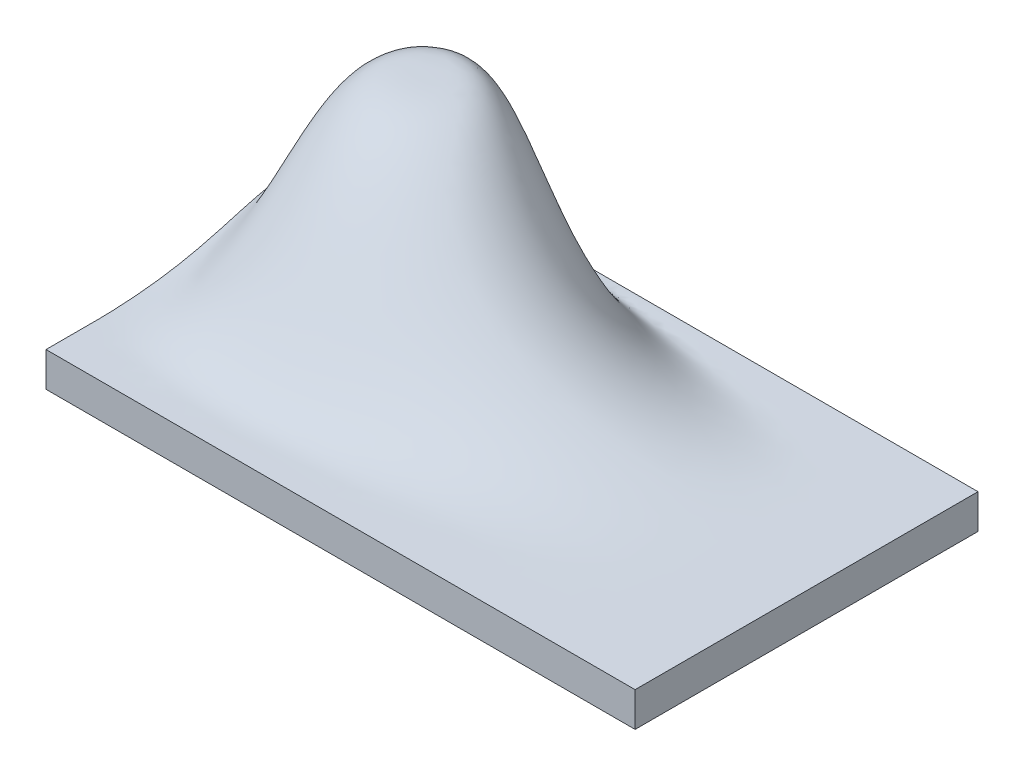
ISO-10303-21;
HEADER;
FILE_DESCRIPTION(('STEP AP214'),'2;1');
FILE_NAME('part.step','',(''),(''),'','','');
FILE_SCHEMA(('AUTOMOTIVE_DESIGN { 1 0 10303 214 1 1 1 1 }'));
ENDSEC;
DATA;
#1=APPLICATION_CONTEXT('core data for automotive mechanical design processes');
#2=APPLICATION_PROTOCOL_DEFINITION('international standard','automotive_design',2000,#1);
#3=PRODUCT_CONTEXT('',#1,'mechanical');
#4=PRODUCT('Part','Part','',(#3));
#5=PRODUCT_RELATED_PRODUCT_CATEGORY('part','',(#4));
#6=PRODUCT_DEFINITION_FORMATION('','',#4);
#7=PRODUCT_DEFINITION_CONTEXT('part definition',#1,'design');
#8=PRODUCT_DEFINITION('design','',#6,#7);
#9=PRODUCT_DEFINITION_SHAPE('','',#8);
#10=(LENGTH_UNIT() NAMED_UNIT(*) SI_UNIT(.MILLI.,.METRE.));
#11=(NAMED_UNIT(*) PLANE_ANGLE_UNIT() SI_UNIT($,.RADIAN.));
#12=(NAMED_UNIT(*) SI_UNIT($,.STERADIAN.) SOLID_ANGLE_UNIT());
#13=UNCERTAINTY_MEASURE_WITH_UNIT(LENGTH_MEASURE(1.E-05),#10,'distance_accuracy_value','');
#14=(GEOMETRIC_REPRESENTATION_CONTEXT(3) GLOBAL_UNCERTAINTY_ASSIGNED_CONTEXT((#13)) GLOBAL_UNIT_ASSIGNED_CONTEXT((#10,
#11,#12)) REPRESENTATION_CONTEXT('',''));
#15=CARTESIAN_POINT('',(0.,0.,0.));
#16=DIRECTION('',(0.,0.,1.));
#17=DIRECTION('',(1.,0.,0.));
#18=AXIS2_PLACEMENT_3D('',#15,#16,#17);
#19=CARTESIAN_POINT('',(-83.5955823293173,10.,-51.8030789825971));
#20=DIRECTION('',(1.,0.,0.));
#21=DIRECTION('',(0.,0.,-1.));
#22=AXIS2_PLACEMENT_3D('',#19,#20,#21);
#23=PLANE('',#22);
#24=DIRECTION('',(0.,0.,-1.));
#25=VECTOR('',#24,1.);
#26=CARTESIAN_POINT('',(-83.5955823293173,0.,-51.8030789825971));
#27=LINE('',#26,#25);
#28=CARTESIAN_POINT('',(-83.5955823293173,0.,-51.8030789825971));
#29=VERTEX_POINT('',#28);
#30=CARTESIAN_POINT('',(-83.5955823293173,0.,47.6887550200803));
#31=VERTEX_POINT('',#30);
#32=EDGE_CURVE('E249',#29,#31,#27,.F.);
#33=ORIENTED_EDGE('',*,*,#32,.T.);
#34=DIRECTION('',(0.,1.,0.));
#35=VECTOR('',#34,1.);
#36=CARTESIAN_POINT('',(-83.5955823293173,10.,47.6887550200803));
#37=LINE('',#36,#35);
#38=CARTESIAN_POINT('',(-83.5955823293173,10.,47.6887550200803));
#39=VERTEX_POINT('',#38);
#40=EDGE_CURVE('E12',#39,#31,#37,.F.);
#41=ORIENTED_EDGE('',*,*,#40,.F.);
#42=CARTESIAN_POINT('',(-83.5955823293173,10.,-51.8030789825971));
#43=CARTESIAN_POINT('',(-83.5955823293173,10.0013495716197,-51.6480575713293));
#44=CARTESIAN_POINT('',(-83.5955823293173,10.0023103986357,-51.4930330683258));
#45=CARTESIAN_POINT('',(-83.5955823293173,10.003529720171,-51.179459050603));
#46=CARTESIAN_POINT('',(-83.5955823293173,10.003771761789,-51.0209094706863));
#47=CARTESIAN_POINT('',(-83.5955823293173,10.0035709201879,-50.7010451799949));
#48=CARTESIAN_POINT('',(-83.5955823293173,10.0031160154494,-50.539730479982));
#49=CARTESIAN_POINT('',(-83.5955823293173,10.0016547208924,-50.2150955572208));
#50=CARTESIAN_POINT('',(-83.5955823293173,10.0006415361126,-50.0517753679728));
#51=CARTESIAN_POINT('',(-83.5955823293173,9.9983629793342,-49.723888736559));
#52=CARTESIAN_POINT('',(-83.5955823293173,9.99709573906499,-49.5593223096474));
#53=CARTESIAN_POINT('',(-83.5955823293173,9.99487558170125,-49.2297004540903));
#54=CARTESIAN_POINT('',(-83.5955823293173,9.99392360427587,-49.0646450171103));
#55=CARTESIAN_POINT('',(-83.5955823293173,9.9933343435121,-48.7508413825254));
#56=CARTESIAN_POINT('',(-83.5955823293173,9.99357643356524,-48.6020936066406));
#57=CARTESIAN_POINT('',(-83.5955823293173,9.99620925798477,-48.3051756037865));
#58=CARTESIAN_POINT('',(-83.5955823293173,9.99859181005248,-48.1570053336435));
#59=CARTESIAN_POINT('',(-83.5955823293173,10.0048463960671,-47.9353293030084));
#60=CARTESIAN_POINT('',(-83.5955823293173,10.0073647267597,-47.8617880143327));
#61=CARTESIAN_POINT('',(-83.5955823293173,10.0136402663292,-47.714761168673));
#62=CARTESIAN_POINT('',(-83.5955823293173,10.0173974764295,-47.641275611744));
#63=CARTESIAN_POINT('',(-83.5955823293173,10.0311195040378,-47.4223067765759));
#64=CARTESIAN_POINT('',(-83.5955823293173,10.0435577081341,-47.2769433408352));
#65=CARTESIAN_POINT('',(-83.5955823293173,10.0698202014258,-47.0604360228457));
#66=CARTESIAN_POINT('',(-83.5955823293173,10.07978357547,-46.9888247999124));
#67=CARTESIAN_POINT('',(-83.5955823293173,10.102616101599,-46.8460708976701));
#68=CARTESIAN_POINT('',(-83.5955823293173,10.1154848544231,-46.7749281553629));
#69=CARTESIAN_POINT('',(-83.5955823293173,10.1443730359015,-46.6335587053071));
#70=CARTESIAN_POINT('',(-83.5955823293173,10.1603804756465,-46.5633295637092));
#71=CARTESIAN_POINT('',(-83.5955823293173,10.1957357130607,-46.4237226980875));
#72=CARTESIAN_POINT('',(-83.5955823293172,10.2150832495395,-46.3543449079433));
#73=CARTESIAN_POINT('',(-83.5955823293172,10.2812657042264,-46.1377141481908));
#74=CARTESIAN_POINT('',(-83.5955823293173,10.3341965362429,-45.9923080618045));
#75=CARTESIAN_POINT('',(-83.5955823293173,10.4514260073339,-45.7061162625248));
#76=CARTESIAN_POINT('',(-83.5955823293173,10.5157377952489,-45.5653361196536));
#77=CARTESIAN_POINT('',(-83.5955823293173,10.65356456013,-45.2855816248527));
#78=CARTESIAN_POINT('',(-83.5955823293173,10.7272109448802,-45.1466727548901));
#79=CARTESIAN_POINT('',(-83.5955823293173,10.8803517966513,-44.8722318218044));
#80=CARTESIAN_POINT('',(-83.5955823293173,10.9598439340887,-44.7366984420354));
#81=CARTESIAN_POINT('',(-83.5955823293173,11.1234216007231,-44.467165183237));
#82=CARTESIAN_POINT('',(-83.5955823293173,11.2075351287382,-44.3331824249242));
#83=CARTESIAN_POINT('',(-83.5955823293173,11.3357003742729,-44.133492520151));
#84=CARTESIAN_POINT('',(-83.5955823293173,11.3787564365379,-44.0671405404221));
#85=CARTESIAN_POINT('',(-83.5955823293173,11.4653803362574,-43.9347712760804));
#86=CARTESIAN_POINT('',(-83.5955823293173,11.5089481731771,-43.8687539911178));
#87=CARTESIAN_POINT('',(-83.5955823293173,11.6423833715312,-43.6679691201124));
#88=CARTESIAN_POINT('',(-83.5955823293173,11.7329266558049,-43.5336509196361));
#89=CARTESIAN_POINT('',(-83.5955823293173,11.915274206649,-43.2658833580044));
#90=CARTESIAN_POINT('',(-83.5955823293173,12.0070784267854,-43.1324339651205));
#91=CARTESIAN_POINT('',(-83.5955823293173,12.1908077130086,-42.8671123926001));
#92=CARTESIAN_POINT('',(-83.5955823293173,12.2827265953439,-42.7352359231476));
#93=CARTESIAN_POINT('',(-83.5955823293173,12.4670047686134,-42.4717900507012));
#94=CARTESIAN_POINT('',(-83.5955823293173,12.5593640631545,-42.3402206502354));
#95=CARTESIAN_POINT('',(-83.5955823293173,12.8361882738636,-41.9462281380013));
#96=CARTESIAN_POINT('',(-83.5955823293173,13.0208189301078,-41.6839216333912));
#97=CARTESIAN_POINT('',(-83.5955823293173,13.3493459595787,-41.2140530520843));
#98=CARTESIAN_POINT('',(-83.5955823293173,13.4935554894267,-41.0067110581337));
#99=CARTESIAN_POINT('',(-83.5955823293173,13.780149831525,-40.5907730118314));
#100=CARTESIAN_POINT('',(-83.5955823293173,13.922534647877,-40.3821769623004));
#101=CARTESIAN_POINT('',(-83.5955823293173,14.3465401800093,-39.7528477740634));
#102=CARTESIAN_POINT('',(-83.5955823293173,14.6243487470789,-39.32950824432));
#103=CARTESIAN_POINT('',(-83.5955823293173,15.0296774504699,-38.6871018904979));
#104=CARTESIAN_POINT('',(-83.5955823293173,15.162936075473,-38.4716538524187));
#105=CARTESIAN_POINT('',(-83.5955823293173,15.4250274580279,-38.0380782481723));
#106=CARTESIAN_POINT('',(-83.5955823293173,15.5538602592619,-37.8199507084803));
#107=CARTESIAN_POINT('',(-83.5955823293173,15.8064642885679,-37.3807072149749));
#108=CARTESIAN_POINT('',(-83.5955823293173,15.9302342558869,-37.1595905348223));
#109=CARTESIAN_POINT('',(-83.5955823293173,16.1722409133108,-36.7143467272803));
#110=CARTESIAN_POINT('',(-83.5955823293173,16.2904775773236,-36.4902195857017));
#111=CARTESIAN_POINT('',(-83.5955823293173,16.519121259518,-36.0432432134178));
#112=CARTESIAN_POINT('',(-83.5955823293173,16.6296329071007,-35.8204475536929));
#113=CARTESIAN_POINT('',(-83.5955823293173,16.8449466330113,-35.3721195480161));
#114=CARTESIAN_POINT('',(-83.5955823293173,16.9497486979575,-35.1465871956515));
#115=CARTESIAN_POINT('',(-83.5955823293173,17.2553070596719,-34.4658678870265));
#116=CARTESIAN_POINT('',(-83.5955823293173,17.4471721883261,-34.0066431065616));
#117=CARTESIAN_POINT('',(-83.5955823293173,17.804913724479,-33.0782558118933));
#118=CARTESIAN_POINT('',(-83.5955823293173,17.9707954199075,-32.6090953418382));
#119=CARTESIAN_POINT('',(-83.5955823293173,18.199287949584,-31.8989446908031));
#120=CARTESIAN_POINT('',(-83.5955823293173,18.2720576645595,-31.6611830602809));
#121=CARTESIAN_POINT('',(-83.5955823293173,18.4106957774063,-31.1836457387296));
#122=CARTESIAN_POINT('',(-83.5955823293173,18.4765640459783,-30.943870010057));
#123=CARTESIAN_POINT('',(-83.5955823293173,18.6190336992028,-30.3937951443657));
#124=CARTESIAN_POINT('',(-83.5955823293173,18.6933340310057,-30.0828969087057));
#125=CARTESIAN_POINT('',(-83.5955823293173,18.8299234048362,-29.4584653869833));
#126=CARTESIAN_POINT('',(-83.5955823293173,18.8922120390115,-29.1449320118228));
#127=CARTESIAN_POINT('',(-83.5955823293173,19.0049832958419,-28.5157252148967));
#128=CARTESIAN_POINT('',(-83.5955823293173,19.0554649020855,-28.200051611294));
#129=CARTESIAN_POINT('',(-83.5955823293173,19.1448257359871,-27.5670715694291));
#130=CARTESIAN_POINT('',(-83.5955823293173,19.1837050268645,-27.2497651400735));
#131=CARTESIAN_POINT('',(-83.5955823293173,19.2500517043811,-26.6140234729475));
#132=CARTESIAN_POINT('',(-83.5955823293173,19.2775212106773,-26.2955884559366));
#133=CARTESIAN_POINT('',(-83.5955823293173,19.3212617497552,-25.6579541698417));
#134=CARTESIAN_POINT('',(-83.5955823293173,19.3375327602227,-25.338754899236));
#135=CARTESIAN_POINT('',(-83.5955823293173,19.3594734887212,-24.6971980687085));
#136=CARTESIAN_POINT('',(-83.5955823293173,19.3650490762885,-24.3748373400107));
#137=CARTESIAN_POINT('',(-83.5955823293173,19.3658099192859,-23.7301084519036));
#138=CARTESIAN_POINT('',(-83.5955823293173,19.3609951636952,-23.4077402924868));
#139=CARTESIAN_POINT('',(-83.5955823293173,19.3414407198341,-22.7632741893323));
#140=CARTESIAN_POINT('',(-83.5955823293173,19.3266999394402,-22.441176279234));
#141=CARTESIAN_POINT('',(-83.5955823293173,19.2877957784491,-21.7975552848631));
#142=CARTESIAN_POINT('',(-83.5955823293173,19.2636323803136,-21.4760322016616));
#143=CARTESIAN_POINT('',(-83.5955823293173,19.2066003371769,-20.8337467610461));
#144=CARTESIAN_POINT('',(-83.5955823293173,19.1737311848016,-20.5129844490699));
#145=CARTESIAN_POINT('',(-83.5955823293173,19.0999567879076,-19.8723915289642));
#146=CARTESIAN_POINT('',(-83.5955823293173,19.0590515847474,-19.5525609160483));
#147=CARTESIAN_POINT('',(-83.5955823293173,18.9768980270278,-18.9644173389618));
#148=CARTESIAN_POINT('',(-83.5955823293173,18.9367261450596,-18.6959529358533));
#149=CARTESIAN_POINT('',(-83.5955823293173,18.851531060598,-18.1598020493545));
#150=CARTESIAN_POINT('',(-83.5955823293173,18.8065079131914,-17.8921155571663));
#151=CARTESIAN_POINT('',(-83.5955823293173,18.6648833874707,-17.0903860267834));
#152=CARTESIAN_POINT('',(-83.5955823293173,18.5617017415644,-16.5574967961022));
#153=CARTESIAN_POINT('',(-83.5955823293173,18.3963847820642,-15.7604406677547));
#154=CARTESIAN_POINT('',(-83.5955823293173,18.3395258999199,-15.4951527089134));
#155=CARTESIAN_POINT('',(-83.5955823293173,18.2227204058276,-14.965255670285));
#156=CARTESIAN_POINT('',(-83.5955823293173,18.1627737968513,-14.7006465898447));
#157=CARTESIAN_POINT('',(-83.5955823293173,17.979070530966,-13.9089303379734));
#158=CARTESIAN_POINT('',(-83.5955823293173,17.8512068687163,-13.3827754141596));
#159=CARTESIAN_POINT('',(-83.5955823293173,17.5867895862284,-12.3326374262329));
#160=CARTESIAN_POINT('',(-83.5955823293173,17.4502354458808,-11.8086544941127));
#161=CARTESIAN_POINT('',(-83.5955823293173,17.2405909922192,-11.0238848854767));
#162=CARTESIAN_POINT('',(-83.5955823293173,17.1698955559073,-10.7624539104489));
#163=CARTESIAN_POINT('',(-83.5955823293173,17.0272054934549,-10.2399467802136));
#164=CARTESIAN_POINT('',(-83.5955823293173,16.9552108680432,-9.97887062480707));
#165=CARTESIAN_POINT('',(-83.5955823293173,16.7369328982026,-9.19320261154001));
#166=CARTESIAN_POINT('',(-83.5955823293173,16.5891273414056,-8.66903468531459));
#167=CARTESIAN_POINT('',(-83.5955823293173,16.3662973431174,-7.8831022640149));
#168=CARTESIAN_POINT('',(-83.5955823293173,16.2918335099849,-7.62117725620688));
#169=CARTESIAN_POINT('',(-83.5955823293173,16.1428206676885,-7.09735137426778));
#170=CARTESIAN_POINT('',(-83.5955823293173,16.0682716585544,-6.83545050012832));
#171=CARTESIAN_POINT('',(-83.5955823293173,15.8446535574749,-6.04961703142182));
#172=CARTESIAN_POINT('',(-83.5955823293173,15.6956457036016,-5.5256670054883));
#173=CARTESIAN_POINT('',(-83.5955823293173,15.3990068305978,-4.47737613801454));
#174=CARTESIAN_POINT('',(-83.5955823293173,15.2513758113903,-3.9530352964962));
#175=CARTESIAN_POINT('',(-83.5955823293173,14.9588049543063,-2.90377583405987));
#176=CARTESIAN_POINT('',(-83.5955823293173,14.8138642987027,-2.3788574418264));
#177=CARTESIAN_POINT('',(-83.5955823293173,14.5279623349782,-1.32793891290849));
#178=CARTESIAN_POINT('',(-83.5955823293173,14.3870009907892,-0.801938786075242));
#179=CARTESIAN_POINT('',(-83.5955823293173,14.1105837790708,0.251204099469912));
#180=CARTESIAN_POINT('',(-83.5955823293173,13.9751249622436,0.778346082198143));
#181=CARTESIAN_POINT('',(-83.5955823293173,13.7101159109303,1.83411725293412));
#182=CARTESIAN_POINT('',(-83.5955823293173,13.5805657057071,2.36274644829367));
#183=CARTESIAN_POINT('',(-83.5955823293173,13.3278621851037,3.42132515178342));
#184=CARTESIAN_POINT('',(-83.5955823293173,13.2047065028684,3.95127409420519));
#185=CARTESIAN_POINT('',(-83.5955823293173,12.9651808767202,5.01270342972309));
#186=CARTESIAN_POINT('',(-83.5955823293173,12.8488109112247,5.54418381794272));
#187=CARTESIAN_POINT('',(-83.5955823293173,12.6233145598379,6.60871024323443));
#188=CARTESIAN_POINT('',(-83.5955823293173,12.5141885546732,7.14175636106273));
#189=CARTESIAN_POINT('',(-83.5955823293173,12.3034908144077,8.20934018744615));
#190=CARTESIAN_POINT('',(-83.5955823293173,12.2019190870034,8.74387789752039));
#191=CARTESIAN_POINT('',(-83.5955823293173,12.0064263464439,9.8134766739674));
#192=CARTESIAN_POINT('',(-83.5955823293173,11.9124934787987,10.3485355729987));
#193=CARTESIAN_POINT('',(-83.5955823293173,11.7320536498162,11.4199004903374));
#194=CARTESIAN_POINT('',(-83.5955823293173,11.645546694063,11.9562065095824));
#195=CARTESIAN_POINT('',(-83.5955823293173,11.3968803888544,13.5678269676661));
#196=CARTESIAN_POINT('',(-83.5955823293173,11.2457544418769,14.6448634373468));
#197=CARTESIAN_POINT('',(-83.5955823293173,10.9716027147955,16.8032577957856));
#198=CARTESIAN_POINT('',(-83.5955823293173,10.8485971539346,17.8846182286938));
#199=CARTESIAN_POINT('',(-83.5955823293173,10.6288578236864,20.0504268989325));
#200=CARTESIAN_POINT('',(-83.5955823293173,10.532134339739,21.1348761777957));
#201=CARTESIAN_POINT('',(-83.5955823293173,10.4050260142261,22.7628751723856));
#202=CARTESIAN_POINT('',(-83.5955823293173,10.3656537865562,23.3057433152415));
#203=CARTESIAN_POINT('',(-83.5955823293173,10.2925973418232,24.3918693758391));
#204=CARTESIAN_POINT('',(-83.5955823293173,10.2589131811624,24.9351272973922));
#205=CARTESIAN_POINT('',(-83.5955823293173,10.1969017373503,26.021614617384));
#206=CARTESIAN_POINT('',(-83.5955823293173,10.1685711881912,26.564843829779));
#207=CARTESIAN_POINT('',(-83.5955823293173,10.1181517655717,27.6515878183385));
#208=CARTESIAN_POINT('',(-83.5955823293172,10.0960627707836,28.1951025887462));
#209=CARTESIAN_POINT('',(-83.5955823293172,10.0686161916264,29.0016850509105));
#210=CARTESIAN_POINT('',(-83.5955823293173,10.0605084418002,29.2646608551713));
#211=CARTESIAN_POINT('',(-83.5955823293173,10.0459835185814,29.7906593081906));
#212=CARTESIAN_POINT('',(-83.5955823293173,10.0395663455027,30.0536819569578));
#213=CARTESIAN_POINT('',(-83.5955823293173,10.0282488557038,30.5796560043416));
#214=CARTESIAN_POINT('',(-83.5955823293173,10.0233479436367,30.8426073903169));
#215=CARTESIAN_POINT('',(-83.5955823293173,10.0149248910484,31.3685320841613));
#216=CARTESIAN_POINT('',(-83.5955823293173,10.0114027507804,31.6315053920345));
#217=CARTESIAN_POINT('',(-83.5955823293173,10.0055913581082,32.1574077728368));
#218=CARTESIAN_POINT('',(-83.5955823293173,10.0033018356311,32.420336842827));
#219=CARTESIAN_POINT('',(-83.5955823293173,9.99983980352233,32.9462020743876));
#220=CARTESIAN_POINT('',(-83.5955823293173,9.99866729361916,33.2091382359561));
#221=CARTESIAN_POINT('',(-83.5955823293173,9.99642679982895,33.9978892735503));
#222=CARTESIAN_POINT('',(-83.5955823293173,9.99663529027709,34.5237069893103));
#223=CARTESIAN_POINT('',(-83.5955823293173,9.99808382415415,35.5752976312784));
#224=CARTESIAN_POINT('',(-83.5955823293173,9.99932378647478,36.1010705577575));
#225=CARTESIAN_POINT('',(-83.5955823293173,10.0006579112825,37.1525855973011));
#226=CARTESIAN_POINT('',(-83.5955823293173,10.0007521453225,37.6783277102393));
#227=CARTESIAN_POINT('',(-83.5955823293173,10.000550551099,38.7308864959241));
#228=CARTESIAN_POINT('',(-83.5955823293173,10.0002539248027,39.2577031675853));
#229=CARTESIAN_POINT('',(-83.5955823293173,9.99995590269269,40.3113571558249));
#230=CARTESIAN_POINT('',(-83.5955823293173,9.9999545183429,40.8381944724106));
#231=CARTESIAN_POINT('',(-83.5955823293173,9.99997903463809,41.8919072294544));
#232=CARTESIAN_POINT('',(-83.5955823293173,10.00000493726,42.4187826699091));
#233=CARTESIAN_POINT('',(-83.5955823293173,10.000016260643,43.4725894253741));
#234=CARTESIAN_POINT('',(-83.5955823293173,10.0000016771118,43.9995207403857));
#235=CARTESIAN_POINT('',(-83.5955823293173,9.99999211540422,45.053456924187));
#236=CARTESIAN_POINT('',(-83.5955823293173,9.99999713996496,45.5804617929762));
#237=CARTESIAN_POINT('',(-83.5955823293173,10.0000053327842,46.6345627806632));
#238=CARTESIAN_POINT('',(-83.5955823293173,10.0000085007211,47.161658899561));
#239=CARTESIAN_POINT('',(-83.5955823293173,10.,47.6887550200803));
#240=B_SPLINE_CURVE_WITH_KNOTS('',3,(#42,#43,#44,#45,#46,#47,#48,#49,#50,#51,#52,#53,#54,#55,
#56,#57,#58,#59,#60,#61,#62,#63,#64,#65,#66,#67,#68,#69,#70,#71,#72,#73,#74,#75,#76,#77,#78,#79,
#80,#81,#82,#83,#84,#85,#86,#87,#88,#89,#90,#91,#92,#93,#94,#95,#96,#97,#98,#99,#100,#101,#102,
#103,#104,#105,#106,#107,#108,#109,#110,#111,#112,#113,#114,#115,#116,#117,#118,#119,#120,#121,
#122,#123,#124,#125,#126,#127,#128,#129,#130,#131,#132,#133,#134,#135,#136,#137,#138,#139,#140,
#141,#142,#143,#144,#145,#146,#147,#148,#149,#150,#151,#152,#153,#154,#155,#156,#157,#158,#159,
#160,#161,#162,#163,#164,#165,#166,#167,#168,#169,#170,#171,#172,#173,#174,#175,#176,#177,#178,
#179,#180,#181,#182,#183,#184,#185,#186,#187,#188,#189,#190,#191,#192,#193,#194,#195,#196,#197,
#198,#199,#200,#201,#202,#203,#204,#205,#206,#207,#208,#209,#210,#211,#212,#213,#214,#215,#216,
#217,#218,#219,#220,#221,#222,#223,#224,#225,#226,#227,#228,#229,#230,#231,#232,#233,#234,#235,
#236,#237,#238,#239),.UNSPECIFIED.,.F.,.F.,(4,2,2,2,2,2,2,2,2,2,2,2,2,2,2,2,2,2,2,2,2,2,2,2,2,2,
2,2,2,2,2,2,2,2,2,2,2,2,2,2,2,2,2,2,2,2,2,2,2,2,2,2,2,2,2,2,2,2,2,2,2,2,2,2,2,2,2,2,2,2,2,2,2,2,
2,2,2,2,2,2,2,2,2,2,2,2,2,2,2,2,2,2,2,2,2,2,2,2,4),(0.,0.465080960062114,0.940728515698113,
1.42467329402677,1.91464272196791,2.40835696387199,2.90352979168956,3.34976745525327,
3.7943065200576,4.01504954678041,4.2357927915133,4.67317678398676,4.8900305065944,
5.10685444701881,5.32286577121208,5.53886021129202,6.0023227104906,6.46632420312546,
6.93779005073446,7.40906902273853,7.88361182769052,8.12090285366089,8.35819363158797,
8.84414010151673,9.3300687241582,9.81231625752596,10.2945677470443,11.2568768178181,
12.0145512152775,12.7722239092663,14.2910069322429,15.0509516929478,15.8108889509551,
16.5710143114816,17.3311432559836,18.0771552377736,18.8231689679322,20.3154807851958,
21.8074885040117,22.553346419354,23.299218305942,24.2579371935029,25.2166886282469,
26.1755225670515,27.1343512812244,28.093001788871,29.0516542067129,30.0187057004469,
30.9857582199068,31.952917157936,32.9200778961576,33.8872950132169,34.8545071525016,
35.6688198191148,36.4831232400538,38.1111965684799,38.9251235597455,39.7390497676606,
41.3633507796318,42.9877490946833,43.8002093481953,44.6126691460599,46.2464854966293,
47.0633985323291,47.8803112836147,49.5144905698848,51.1486697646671,52.7823438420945,
54.4160031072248,56.0487748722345,57.6815547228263,59.3137258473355,60.9458917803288,
62.5781434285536,64.2103967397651,65.8400666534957,67.4697377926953,70.7320686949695,
73.9967379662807,77.2626830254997,78.8955411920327,80.5284155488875,82.1602905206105,
83.7921337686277,84.5814312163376,85.3707288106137,86.1597160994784,86.948703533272,
87.7375180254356,88.5263323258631,90.1037800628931,91.6811037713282,93.2583289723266,
94.8387794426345,96.4192912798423,97.9999176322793,99.5807115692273,101.161726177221,
102.743014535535),.UNSPECIFIED.);
#241=CARTESIAN_POINT('',(-83.5955823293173,10.,-51.8030789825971));
#242=VERTEX_POINT('',#241);
#243=EDGE_CURVE('E263',#242,#39,#240,.T.);
#244=ORIENTED_EDGE('',*,*,#243,.F.);
#245=DIRECTION('',(0.,1.,0.));
#246=VECTOR('',#245,1.);
#247=CARTESIAN_POINT('',(-83.5955823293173,10.,-51.8030789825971));
#248=LINE('',#247,#246);
#249=EDGE_CURVE('E206',#242,#29,#248,.F.);
#250=ORIENTED_EDGE('',*,*,#249,.T.);
#251=EDGE_LOOP('',(#33,#41,#244,#250));
#252=FACE_BOUND('',#251,.T.);
#253=ADVANCED_FACE('F202',(#252),#23,.F.);
#254=CARTESIAN_POINT('',(-83.5955823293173,10.,47.6887550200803));
#255=DIRECTION('',(0.,0.,-1.));
#256=DIRECTION('',(-1.,0.,0.));
#257=AXIS2_PLACEMENT_3D('',#254,#255,#256);
#258=PLANE('',#257);
#259=DIRECTION('',(1.,0.,0.));
#260=VECTOR('',#259,1.);
#261=CARTESIAN_POINT('',(-83.5955823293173,0.,47.6887550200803));
#262=LINE('',#261,#260);
#263=CARTESIAN_POINT('',(87.3358768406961,0.,47.6887550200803));
#264=VERTEX_POINT('',#263);
#265=EDGE_CURVE('E239',#31,#264,#262,.T.);
#266=ORIENTED_EDGE('',*,*,#265,.T.);
#267=DIRECTION('',(0.,-1.,0.));
#268=VECTOR('',#267,1.);
#269=CARTESIAN_POINT('',(87.3358768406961,10.,47.6887550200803));
#270=LINE('',#269,#268);
#271=CARTESIAN_POINT('',(87.3358768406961,10.,47.6887550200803));
#272=VERTEX_POINT('',#271);
#273=EDGE_CURVE('E212',#272,#264,#270,.T.);
#274=ORIENTED_EDGE('',*,*,#273,.F.);
#275=DIRECTION('',(-1.,0.,0.));
#276=VECTOR('',#275,1.);
#277=CARTESIAN_POINT('',(-83.5955823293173,10.,47.6887550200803));
#278=LINE('',#277,#276);
#279=EDGE_CURVE('E271',#39,#272,#278,.F.);
#280=ORIENTED_EDGE('',*,*,#279,.F.);
#281=ORIENTED_EDGE('',*,*,#40,.T.);
#282=EDGE_LOOP('',(#266,#274,#280,#281));
#283=FACE_BOUND('',#282,.T.);
#284=ADVANCED_FACE('F241',(#283),#258,.F.);
#285=CARTESIAN_POINT('',(87.3358768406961,10.,-51.8030789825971));
#286=DIRECTION('',(-1.,0.,0.));
#287=DIRECTION('',(0.,0.,1.));
#288=AXIS2_PLACEMENT_3D('',#285,#286,#287);
#289=PLANE('',#288);
#290=DIRECTION('',(0.,0.,-1.));
#291=VECTOR('',#290,1.);
#292=CARTESIAN_POINT('',(87.3358768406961,0.,-51.8030789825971));
#293=LINE('',#292,#291);
#294=CARTESIAN_POINT('',(87.3358768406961,0.,-51.8030789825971));
#295=VERTEX_POINT('',#294);
#296=EDGE_CURVE('E248',#264,#295,#293,.T.);
#297=ORIENTED_EDGE('',*,*,#296,.T.);
#298=DIRECTION('',(0.,-1.,0.));
#299=VECTOR('',#298,1.);
#300=CARTESIAN_POINT('',(87.3358768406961,10.,-51.8030789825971));
#301=LINE('',#300,#299);
#302=CARTESIAN_POINT('',(87.3358768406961,10.,-51.8030789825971));
#303=VERTEX_POINT('',#302);
#304=EDGE_CURVE('E256',#303,#295,#301,.T.);
#305=ORIENTED_EDGE('',*,*,#304,.F.);
#306=DIRECTION('',(0.,0.,1.));
#307=VECTOR('',#306,1.);
#308=CARTESIAN_POINT('',(87.3358768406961,10.,-51.8030789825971));
#309=LINE('',#308,#307);
#310=EDGE_CURVE('E255',#272,#303,#309,.F.);
#311=ORIENTED_EDGE('',*,*,#310,.F.);
#312=ORIENTED_EDGE('',*,*,#273,.T.);
#313=EDGE_LOOP('',(#297,#305,#311,#312));
#314=FACE_BOUND('',#313,.T.);
#315=ADVANCED_FACE('F252',(#314),#289,.F.);
#316=CARTESIAN_POINT('',(-83.5955823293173,10.,-51.8030789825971));
#317=DIRECTION('',(0.,0.,1.));
#318=DIRECTION('',(1.,0.,0.));
#319=AXIS2_PLACEMENT_3D('',#316,#317,#318);
#320=PLANE('',#319);
#321=DIRECTION('',(-1.,0.,0.));
#322=VECTOR('',#321,1.);
#323=CARTESIAN_POINT('',(-83.5955823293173,0.,-51.8030789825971));
#324=LINE('',#323,#322);
#325=EDGE_CURVE('E261',#295,#29,#324,.T.);
#326=ORIENTED_EDGE('',*,*,#325,.T.);
#327=ORIENTED_EDGE('',*,*,#249,.F.);
#328=DIRECTION('',(1.,0.,0.));
#329=VECTOR('',#328,1.);
#330=CARTESIAN_POINT('',(-83.5955823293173,10.,-51.8030789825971));
#331=LINE('',#330,#329);
#332=EDGE_CURVE('E219',#303,#242,#331,.F.);
#333=ORIENTED_EDGE('',*,*,#332,.F.);
#334=ORIENTED_EDGE('',*,*,#304,.T.);
#335=EDGE_LOOP('',(#326,#327,#333,#334));
#336=FACE_BOUND('',#335,.T.);
#337=ADVANCED_FACE('F279',(#336),#320,.F.);
#338=CARTESIAN_POINT('',(-83.5955823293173,10.,-51.8030789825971));
#339=CARTESIAN_POINT('',(-81.0927712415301,10.,-51.8030789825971));
#340=CARTESIAN_POINT('',(-77.8335412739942,10.,-51.8030789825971));
#341=CARTESIAN_POINT('',(-73.6679242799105,10.,-51.8030789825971));
#342=CARTESIAN_POINT('',(-69.787855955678,10.,-51.803078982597));
#343=CARTESIAN_POINT('',(-64.9106750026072,10.,-51.8030789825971));
#344=CARTESIAN_POINT('',(-58.9678723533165,10.,-51.8030789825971));
#345=CARTESIAN_POINT('',(-52.3019600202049,10.,-51.8030789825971));
#346=CARTESIAN_POINT('',(-45.5678629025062,10.,-51.8030789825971));
#347=CARTESIAN_POINT('',(-39.0322725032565,10.,-51.803078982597));
#348=CARTESIAN_POINT('',(-32.6975256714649,10.,-51.803078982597));
#349=CARTESIAN_POINT('',(-26.4776345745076,10.,-51.8030789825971));
#350=CARTESIAN_POINT('',(-20.2820901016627,10.,-51.8030789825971));
#351=CARTESIAN_POINT('',(-14.0496697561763,10.,-51.803078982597));
#352=CARTESIAN_POINT('',(-7.76573309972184,10.,-51.8030789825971));
#353=CARTESIAN_POINT('',(-1.43938223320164,10.,-51.803078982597));
#354=CARTESIAN_POINT('',(4.91197901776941,10.,-51.803078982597));
#355=CARTESIAN_POINT('',(11.2723257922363,10.,-51.8030789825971));
#356=CARTESIAN_POINT('',(17.6313731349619,10.,-51.803078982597));
#357=CARTESIAN_POINT('',(23.9845818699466,10.,-51.8030789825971));
#358=CARTESIAN_POINT('',(30.3312714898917,10.,-51.8030789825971));
#359=CARTESIAN_POINT('',(36.6725027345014,10.,-51.8030789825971));
#360=CARTESIAN_POINT('',(43.0097724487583,10.,-51.803078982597));
#361=CARTESIAN_POINT('',(49.3444800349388,10.,-51.803078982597));
#362=CARTESIAN_POINT('',(55.6778139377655,10.,-51.8030789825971));
#363=CARTESIAN_POINT('',(62.0109635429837,10.,-51.8030789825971));
#364=CARTESIAN_POINT('',(67.991588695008,10.,-51.803078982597));
#365=CARTESIAN_POINT('',(76.4327946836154,10.,-51.8030789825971));
#366=CARTESIAN_POINT('',(82.7636367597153,10.,-51.8030789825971));
#367=CARTESIAN_POINT('',(87.335876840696,10.,-51.8030789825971));
#368=CARTESIAN_POINT('',(-83.5955823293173,10.0155130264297,-50.0107764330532));
#369=CARTESIAN_POINT('',(-81.0927712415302,10.0083185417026,-50.0107764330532));
#370=CARTESIAN_POINT('',(-77.8335412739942,10.1949748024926,-50.0107764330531));
#371=CARTESIAN_POINT('',(-73.6679242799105,9.87649884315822,-50.0107764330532));
#372=CARTESIAN_POINT('',(-69.787855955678,9.88465263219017,-50.0107764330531));
#373=CARTESIAN_POINT('',(-64.9106750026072,9.15945317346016,-50.0107764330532));
#374=CARTESIAN_POINT('',(-58.9678723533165,7.76366261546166,-50.0107764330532));
#375=CARTESIAN_POINT('',(-52.3019600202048,6.57766753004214,-50.0107764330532));
#376=CARTESIAN_POINT('',(-45.5678629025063,6.51681971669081,-50.0107764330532));
#377=CARTESIAN_POINT('',(-39.0322725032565,7.39203756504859,-50.0107764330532));
#378=CARTESIAN_POINT('',(-32.6975256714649,8.55677716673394,-50.0107764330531));
#379=CARTESIAN_POINT('',(-26.4776345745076,9.59883620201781,-50.0107764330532));
#380=CARTESIAN_POINT('',(-20.2820901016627,10.0160048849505,-50.0107764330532));
#381=CARTESIAN_POINT('',(-14.0496697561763,10.1295569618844,-50.0107764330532));
#382=CARTESIAN_POINT('',(-7.76573309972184,10.0632099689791,-50.0107764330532));
#383=CARTESIAN_POINT('',(-1.43938223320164,9.99471573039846,-50.0107764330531));
#384=CARTESIAN_POINT('',(4.91197901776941,9.99108272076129,-50.0107764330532));
#385=CARTESIAN_POINT('',(11.2723257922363,10.0009606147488,-50.0107764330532));
#386=CARTESIAN_POINT('',(17.6313731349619,10.0011087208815,-50.0107764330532));
#387=CARTESIAN_POINT('',(23.9845818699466,10.0000348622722,-50.0107764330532));
#388=CARTESIAN_POINT('',(30.3312714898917,9.9998714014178,-50.0107764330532));
#389=CARTESIAN_POINT('',(36.6725027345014,9.99991208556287,-50.0107764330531));
#390=CARTESIAN_POINT('',(43.0097724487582,10.0000356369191,-50.0107764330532));
#391=CARTESIAN_POINT('',(49.3444800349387,10.00001568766,-50.0107764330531));
#392=CARTESIAN_POINT('',(55.6778139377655,9.99999092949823,-50.0107764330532));
#393=CARTESIAN_POINT('',(62.0109635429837,10.0000026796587,-50.0107764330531));
#394=CARTESIAN_POINT('',(67.991588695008,9.99999942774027,-50.0107764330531));
#395=CARTESIAN_POINT('',(76.4327946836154,10.000000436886,-50.0107764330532));
#396=CARTESIAN_POINT('',(82.7636367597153,9.99999999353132,-50.0107764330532));
#397=CARTESIAN_POINT('',(87.3358768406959,10.,-50.0107764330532));
#398=CARTESIAN_POINT('',(-83.5955823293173,9.94842572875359,-48.1264022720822));
#399=CARTESIAN_POINT('',(-81.0927712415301,9.95852649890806,-48.1264022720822));
#400=CARTESIAN_POINT('',(-77.8335412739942,9.40090708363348,-48.1264022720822));
#401=CARTESIAN_POINT('',(-73.6679242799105,10.1038216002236,-48.1264022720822));
#402=CARTESIAN_POINT('',(-69.787855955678,9.88719831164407,-48.1264022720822));
#403=CARTESIAN_POINT('',(-64.9106750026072,11.5418965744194,-48.1264022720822));
#404=CARTESIAN_POINT('',(-58.9678723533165,14.6737848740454,-48.1264022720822));
#405=CARTESIAN_POINT('',(-52.3019600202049,19.0248809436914,-48.1264022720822));
#406=CARTESIAN_POINT('',(-45.5678629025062,19.8991276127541,-48.1264022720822));
#407=CARTESIAN_POINT('',(-39.0322725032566,16.5543231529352,-48.1264022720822));
#408=CARTESIAN_POINT('',(-32.6975256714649,12.839912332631,-48.1264022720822));
#409=CARTESIAN_POINT('',(-26.4776345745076,10.5678235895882,-48.1264022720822));
#410=CARTESIAN_POINT('',(-20.2820901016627,9.68154590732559,-48.1264022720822));
#411=CARTESIAN_POINT('',(-14.0496697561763,9.54006125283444,-48.1264022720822));
#412=CARTESIAN_POINT('',(-7.76573309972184,9.79710677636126,-48.1264022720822));
#413=CARTESIAN_POINT('',(-1.43938223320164,10.0157490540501,-48.1264022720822));
#414=CARTESIAN_POINT('',(4.91197901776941,10.0301055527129,-48.1264022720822));
#415=CARTESIAN_POINT('',(11.2723257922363,9.99668887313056,-48.1264022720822));
#416=CARTESIAN_POINT('',(17.6313731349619,9.99634441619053,-48.1264022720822));
#417=CARTESIAN_POINT('',(23.9845818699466,9.99987612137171,-48.1264022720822));
#418=CARTESIAN_POINT('',(30.3312714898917,10.0004296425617,-48.1264022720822));
#419=CARTESIAN_POINT('',(36.6725027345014,10.0002917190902,-48.1264022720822));
#420=CARTESIAN_POINT('',(43.0097724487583,9.99988167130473,-48.1264022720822));
#421=CARTESIAN_POINT('',(49.3444800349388,9.99994780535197,-48.1264022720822));
#422=CARTESIAN_POINT('',(55.6778139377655,10.0000301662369,-48.1264022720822));
#423=CARTESIAN_POINT('',(62.0109635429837,9.9999910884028,-48.1264022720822));
#424=CARTESIAN_POINT('',(67.991588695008,10.0000019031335,-48.1264022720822));
#425=CARTESIAN_POINT('',(76.4327946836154,9.99999854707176,-48.1264022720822));
#426=CARTESIAN_POINT('',(82.7636367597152,10.0000000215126,-48.1264022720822));
#427=CARTESIAN_POINT('',(87.335876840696,10.,-48.1264022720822));
#428=CARTESIAN_POINT('',(-83.5955823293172,10.1435368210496,-46.0790259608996));
#429=CARTESIAN_POINT('',(-81.0927712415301,10.2788828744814,-46.0790259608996));
#430=CARTESIAN_POINT('',(-77.8335412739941,11.0879275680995,-46.0790259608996));
#431=CARTESIAN_POINT('',(-73.6679242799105,13.3143368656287,-46.0790259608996));
#432=CARTESIAN_POINT('',(-69.7878559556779,16.0817301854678,-46.0790259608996));
#433=CARTESIAN_POINT('',(-64.9106750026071,20.7972604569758,-46.0790259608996));
#434=CARTESIAN_POINT('',(-58.9678723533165,27.9570917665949,-46.0790259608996));
#435=CARTESIAN_POINT('',(-52.3019600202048,34.7562085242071,-46.0790259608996));
#436=CARTESIAN_POINT('',(-45.5678629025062,35.8334852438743,-46.0790259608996));
#437=CARTESIAN_POINT('',(-39.0322725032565,30.8276812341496,-46.0790259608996));
#438=CARTESIAN_POINT('',(-32.6975256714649,23.6928294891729,-46.0790259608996));
#439=CARTESIAN_POINT('',(-26.4776345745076,17.7849668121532,-46.0790259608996));
#440=CARTESIAN_POINT('',(-20.2820901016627,13.8889911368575,-46.0790259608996));
#441=CARTESIAN_POINT('',(-14.0496697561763,11.6498646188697,-46.0790259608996));
#442=CARTESIAN_POINT('',(-7.76573309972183,10.4727567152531,-46.0790259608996));
#443=CARTESIAN_POINT('',(-1.43938223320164,9.97921890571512,-46.0790259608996));
#444=CARTESIAN_POINT('',(4.91197901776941,9.910391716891,-46.0790259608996));
#445=CARTESIAN_POINT('',(11.2723257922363,10.0107040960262,-46.0790259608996));
#446=CARTESIAN_POINT('',(17.6313731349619,10.0097880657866,-46.0790259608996));
#447=CARTESIAN_POINT('',(23.9845818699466,10.0004458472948,-46.0790259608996));
#448=CARTESIAN_POINT('',(30.3312714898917,9.99877756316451,-46.0790259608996));
#449=CARTESIAN_POINT('',(36.6725027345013,9.99919520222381,-46.0790259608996));
#450=CARTESIAN_POINT('',(43.0097724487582,10.0003274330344,-46.0790259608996));
#451=CARTESIAN_POINT('',(49.3444800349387,10.0001457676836,-46.0790259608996));
#452=CARTESIAN_POINT('',(55.6778139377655,9.99991590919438,-46.0790259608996));
#453=CARTESIAN_POINT('',(62.0109635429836,10.0000248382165,-46.0790259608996));
#454=CARTESIAN_POINT('',(67.9915886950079,9.99999469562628,-46.0790259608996));
#455=CARTESIAN_POINT('',(76.4327946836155,10.0000040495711,-46.0790259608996));
#456=CARTESIAN_POINT('',(82.7636367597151,9.99999994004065,-46.0790259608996));
#457=CARTESIAN_POINT('',(87.3358768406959,10.,-46.0790259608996));
#458=CARTESIAN_POINT('',(-83.5955823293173,11.4406518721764,-43.8847985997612));
#459=CARTESIAN_POINT('',(-81.0927712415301,11.7612141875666,-43.8847985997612));
#460=CARTESIAN_POINT('',(-77.8335412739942,13.3732343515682,-43.8847985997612));
#461=CARTESIAN_POINT('',(-73.6679242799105,17.3833150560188,-43.8847985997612));
#462=CARTESIAN_POINT('',(-69.787855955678,22.2486039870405,-43.8847985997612));
#463=CARTESIAN_POINT('',(-64.9106750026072,29.7793746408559,-43.8847985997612));
#464=CARTESIAN_POINT('',(-58.9678723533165,39.6527721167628,-43.8847985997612));
#465=CARTESIAN_POINT('',(-52.3019600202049,47.2326117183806,-43.8847985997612));
#466=CARTESIAN_POINT('',(-45.5678629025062,48.3328455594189,-43.8847985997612));
#467=CARTESIAN_POINT('',(-39.0322725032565,43.2444420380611,-43.8847985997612));
#468=CARTESIAN_POINT('',(-32.6975256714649,34.5820041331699,-43.8847985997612));
#469=CARTESIAN_POINT('',(-26.4776345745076,25.9972689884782,-43.8847985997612));
#470=CARTESIAN_POINT('',(-20.2820901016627,19.482188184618,-43.8847985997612));
#471=CARTESIAN_POINT('',(-14.0496697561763,15.1910009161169,-43.8847985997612));
#472=CARTESIAN_POINT('',(-7.76573309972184,12.628807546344,-43.8847985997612));
#473=CARTESIAN_POINT('',(-1.43938223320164,11.1745202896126,-43.8847985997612));
#474=CARTESIAN_POINT('',(4.91197901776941,10.371128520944,-43.8847985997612));
#475=CARTESIAN_POINT('',(11.2723257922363,9.97613815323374,-43.8847985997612));
#476=CARTESIAN_POINT('',(17.6313731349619,9.93310292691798,-43.8847985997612));
#477=CARTESIAN_POINT('',(23.9845818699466,10.0000139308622,-43.8847985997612));
#478=CARTESIAN_POINT('',(30.3312714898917,10.0064230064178,-43.8847985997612));
#479=CARTESIAN_POINT('',(36.6725027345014,10.0048648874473,-43.8847985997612));
#480=CARTESIAN_POINT('',(43.0097724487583,9.99804638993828,-43.8847985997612));
#481=CARTESIAN_POINT('',(49.3444800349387,9.99916498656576,-43.8847985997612));
#482=CARTESIAN_POINT('',(55.6778139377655,10.0004857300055,-43.8847985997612));
#483=CARTESIAN_POINT('',(62.0109635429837,9.99985643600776,-43.8847985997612));
#484=CARTESIAN_POINT('',(67.991588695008,10.000030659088,-43.8847985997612));
#485=CARTESIAN_POINT('',(76.4327946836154,9.99997659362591,-43.8847985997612));
#486=CARTESIAN_POINT('',(82.7636367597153,10.0000003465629,-43.8847985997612));
#487=CARTESIAN_POINT('',(87.335876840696,10.,-43.8847985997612));
#488=CARTESIAN_POINT('',(-83.5955823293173,13.5139571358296,-41.024655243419));
#489=CARTESIAN_POINT('',(-81.0927712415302,14.2734912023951,-41.024655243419));
#490=CARTESIAN_POINT('',(-77.8335412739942,17.0549657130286,-41.024655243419));
#491=CARTESIAN_POINT('',(-73.6679242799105,23.1282808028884,-41.024655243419));
#492=CARTESIAN_POINT('',(-69.787855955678,30.1983669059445,-41.024655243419));
#493=CARTESIAN_POINT('',(-64.9106750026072,39.8651025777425,-41.024655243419));
#494=CARTESIAN_POINT('',(-58.9678723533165,50.1525221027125,-41.024655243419));
#495=CARTESIAN_POINT('',(-52.3019600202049,55.8949383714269,-41.024655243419));
#496=CARTESIAN_POINT('',(-45.5678629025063,56.5125617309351,-41.024655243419));
#497=CARTESIAN_POINT('',(-39.0322725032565,53.050141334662,-41.024655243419));
#498=CARTESIAN_POINT('',(-32.6975256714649,45.4308329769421,-41.024655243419));
#499=CARTESIAN_POINT('',(-26.4776345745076,36.0381676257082,-41.024655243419));
#500=CARTESIAN_POINT('',(-20.2820901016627,27.522937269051,-41.024655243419));
#501=CARTESIAN_POINT('',(-14.0496697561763,21.0194722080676,-41.024655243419));
#502=CARTESIAN_POINT('',(-7.76573309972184,16.54757875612,-41.024655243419));
#503=CARTESIAN_POINT('',(-1.43938223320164,13.6820341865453,-41.024655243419));
#504=CARTESIAN_POINT('',(4.91197901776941,11.9416881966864,-41.024655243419));
#505=CARTESIAN_POINT('',(11.2723257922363,10.9278429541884,-41.024655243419));
#506=CARTESIAN_POINT('',(17.6313731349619,10.3410628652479,-41.024655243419));
#507=CARTESIAN_POINT('',(23.9845818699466,10.0412435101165,-41.024655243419));
#508=CARTESIAN_POINT('',(30.3312714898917,9.94118056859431,-41.024655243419));
#509=CARTESIAN_POINT('',(36.6725027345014,9.96661948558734,-41.024655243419));
#510=CARTESIAN_POINT('',(43.0097724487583,10.0137965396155,-41.024655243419));
#511=CARTESIAN_POINT('',(49.3444800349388,10.0064334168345,-41.024655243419));
#512=CARTESIAN_POINT('',(55.6778139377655,9.99632248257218,-41.024655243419));
#513=CARTESIAN_POINT('',(62.0109635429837,10.0010854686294,-41.024655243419));
#514=CARTESIAN_POINT('',(67.991588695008,9.99976819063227,-41.024655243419));
#515=CARTESIAN_POINT('',(76.4327946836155,10.0001769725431,-41.024655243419));
#516=CARTESIAN_POINT('',(82.7636367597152,9.99999737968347,-41.024655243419));
#517=CARTESIAN_POINT('',(87.335876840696,10.,-41.024655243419));
#518=CARTESIAN_POINT('',(-83.5955823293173,15.8537395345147,-37.5032268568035));
#519=CARTESIAN_POINT('',(-81.0927712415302,17.1034009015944,-37.5032268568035));
#520=CARTESIAN_POINT('',(-77.8335412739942,21.1383526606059,-37.5032268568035));
#521=CARTESIAN_POINT('',(-73.6679242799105,29.0366063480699,-37.5032268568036));
#522=CARTESIAN_POINT('',(-69.787855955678,37.5095291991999,-37.5032268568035));
#523=CARTESIAN_POINT('',(-64.9106750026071,47.7714058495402,-37.5032268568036));
#524=CARTESIAN_POINT('',(-58.9678723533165,56.3575420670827,-37.5032268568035));
#525=CARTESIAN_POINT('',(-52.3019600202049,59.4237230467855,-37.5032268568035));
#526=CARTESIAN_POINT('',(-45.5678629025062,59.5813710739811,-37.5032268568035));
#527=CARTESIAN_POINT('',(-39.0322725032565,57.9730988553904,-37.5032268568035));
#528=CARTESIAN_POINT('',(-32.6975256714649,52.6837658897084,-37.5032268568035));
#529=CARTESIAN_POINT('',(-26.4776345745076,44.4111334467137,-37.5032268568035));
#530=CARTESIAN_POINT('',(-20.2820901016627,35.5237633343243,-37.5032268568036));
#531=CARTESIAN_POINT('',(-14.0496697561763,27.7474702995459,-37.5032268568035));
#532=CARTESIAN_POINT('',(-7.76573309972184,21.749845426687,-37.5032268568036));
#533=CARTESIAN_POINT('',(-1.43938223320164,17.4750973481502,-37.5032268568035));
#534=CARTESIAN_POINT('',(4.91197901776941,14.5789667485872,-37.5032268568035));
#535=CARTESIAN_POINT('',(11.2723257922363,12.685478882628,-37.5032268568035));
#536=CARTESIAN_POINT('',(17.6313731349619,11.4882739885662,-37.5032268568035));
#537=CARTESIAN_POINT('',(23.9845818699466,10.751702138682,-37.5032268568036));
#538=CARTESIAN_POINT('',(30.3312714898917,10.3135469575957,-37.5032268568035));
#539=CARTESIAN_POINT('',(36.6725027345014,10.0713761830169,-37.5032268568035));
#540=CARTESIAN_POINT('',(43.0097724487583,9.96545446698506,-37.5032268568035));
#541=CARTESIAN_POINT('',(49.3444800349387,9.97738508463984,-37.5032268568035));
#542=CARTESIAN_POINT('',(55.6778139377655,10.0122066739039,-37.5032268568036));
#543=CARTESIAN_POINT('',(62.0109635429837,9.99641367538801,-37.5032268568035));
#544=CARTESIAN_POINT('',(67.991588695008,10.0007658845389,-37.5032268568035));
#545=CARTESIAN_POINT('',(76.4327946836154,9.99941529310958,-37.5032268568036));
#546=CARTESIAN_POINT('',(82.7636367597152,10.000008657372,-37.5032268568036));
#547=CARTESIAN_POINT('',(87.335876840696,10.,-37.5032268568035));
#548=CARTESIAN_POINT('',(-83.5955823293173,17.6953125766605,-33.6469567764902));
#549=CARTESIAN_POINT('',(-81.0927712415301,19.3342621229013,-33.6469567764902));
#550=CARTESIAN_POINT('',(-77.8335412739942,24.4191528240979,-33.6469567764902));
#551=CARTESIAN_POINT('',(-73.6679242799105,33.5533511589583,-33.6469567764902));
#552=CARTESIAN_POINT('',(-69.787855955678,42.6462219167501,-33.6469567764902));
#553=CARTESIAN_POINT('',(-64.9106750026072,52.4057145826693,-33.6469567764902));
#554=CARTESIAN_POINT('',(-58.9678723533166,58.8639179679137,-33.6469567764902));
#555=CARTESIAN_POINT('',(-52.3019600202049,60.0739477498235,-33.6469567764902));
#556=CARTESIAN_POINT('',(-45.5678629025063,60.0366974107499,-33.6469567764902));
#557=CARTESIAN_POINT('',(-39.0322725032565,59.5675374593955,-33.6469567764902));
#558=CARTESIAN_POINT('',(-32.6975256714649,56.1952410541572,-33.6469567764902));
#559=CARTESIAN_POINT('',(-26.4776345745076,49.5931672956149,-33.6469567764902));
#560=CARTESIAN_POINT('',(-20.2820901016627,41.4274509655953,-33.6469567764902));
#561=CARTESIAN_POINT('',(-14.0496697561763,33.4425338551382,-33.6469567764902));
#562=CARTESIAN_POINT('',(-7.76573309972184,26.6733066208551,-33.6469567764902));
#563=CARTESIAN_POINT('',(-1.43938223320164,21.4335177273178,-33.6469567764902));
#564=CARTESIAN_POINT('',(4.91197901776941,17.6084881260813,-33.6469567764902));
#565=CARTESIAN_POINT('',(11.2723257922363,14.9202121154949,-33.6469567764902));
#566=CARTESIAN_POINT('',(17.6313731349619,13.0780969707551,-33.6469567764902));
#567=CARTESIAN_POINT('',(23.9845818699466,11.8424499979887,-33.6469567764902));
#568=CARTESIAN_POINT('',(30.3312714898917,11.0325902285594,-33.6469567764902));
#569=CARTESIAN_POINT('',(36.6725027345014,10.517871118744,-33.6469567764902));
#570=CARTESIAN_POINT('',(43.0097724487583,10.2067725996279,-33.6469567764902));
#571=CARTESIAN_POINT('',(49.3444800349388,10.0314402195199,-33.6469567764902));
#572=CARTESIAN_POINT('',(55.6778139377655,9.9750734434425,-33.6469567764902));
#573=CARTESIAN_POINT('',(62.0109635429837,10.0075178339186,-33.6469567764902));
#574=CARTESIAN_POINT('',(67.991588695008,9.99839451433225,-33.6469567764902));
#575=CARTESIAN_POINT('',(76.4327946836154,10.0012256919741,-33.6469567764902));
#576=CARTESIAN_POINT('',(82.7636367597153,9.99998185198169,-33.6469567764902));
#577=CARTESIAN_POINT('',(87.335876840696,10.,-33.6469567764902));
#578=CARTESIAN_POINT('',(-83.5955823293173,18.845290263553,-29.8472023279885));
#579=CARTESIAN_POINT('',(-81.0927712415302,20.7164962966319,-29.8472023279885));
#580=CARTESIAN_POINT('',(-77.8335412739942,26.4393584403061,-29.8472023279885));
#581=CARTESIAN_POINT('',(-73.6679242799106,36.2124906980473,-29.8472023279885));
#582=CARTESIAN_POINT('',(-69.787855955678,45.4429215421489,-29.8472023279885));
#583=CARTESIAN_POINT('',(-64.9106750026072,54.5143539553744,-29.8472023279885));
#584=CARTESIAN_POINT('',(-58.9678723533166,59.5940830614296,-29.8472023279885));
#585=CARTESIAN_POINT('',(-52.3019600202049,60.0630246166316,-29.8472023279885));
#586=CARTESIAN_POINT('',(-45.5678629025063,59.9983988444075,-29.8472023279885));
#587=CARTESIAN_POINT('',(-39.0322725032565,59.9314424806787,-29.8472023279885));
#588=CARTESIAN_POINT('',(-32.6975256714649,57.5802280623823,-29.8472023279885));
#589=CARTESIAN_POINT('',(-26.4776345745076,52.2470137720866,-29.8472023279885));
#590=CARTESIAN_POINT('',(-20.2820901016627,45.0099580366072,-29.8472023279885));
#591=CARTESIAN_POINT('',(-14.0496697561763,37.3610944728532,-29.8472023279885));
#592=CARTESIAN_POINT('',(-7.76573309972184,30.4152578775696,-29.8472023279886));
#593=CARTESIAN_POINT('',(-1.43938223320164,24.697909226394,-29.8472023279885));
#594=CARTESIAN_POINT('',(4.91197901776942,20.2851635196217,-29.8472023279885));
#595=CARTESIAN_POINT('',(11.2723257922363,17.0195034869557,-29.8472023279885));
#596=CARTESIAN_POINT('',(17.6313731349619,14.6688764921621,-29.8472023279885));
#597=CARTESIAN_POINT('',(23.9845818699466,13.0092353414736,-29.8472023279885));
#598=CARTESIAN_POINT('',(30.3312714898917,11.8559946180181,-29.8472023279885));
#599=CARTESIAN_POINT('',(36.6725027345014,11.0690175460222,-29.8472023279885));
#600=CARTESIAN_POINT('',(43.0097724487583,10.5454384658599,-29.8472023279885));
#601=CARTESIAN_POINT('',(49.3444800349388,10.2183542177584,-29.8472023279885));
#602=CARTESIAN_POINT('',(55.6778139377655,10.0256500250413,-29.8472023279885));
#603=CARTESIAN_POINT('',(62.0109635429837,9.99062099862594,-29.8472023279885));
#604=CARTESIAN_POINT('',(67.991588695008,10.0020029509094,-29.8472023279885));
#605=CARTESIAN_POINT('',(76.4327946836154,9.99847086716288,-29.8472023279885));
#606=CARTESIAN_POINT('',(82.7636367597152,10.0000226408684,-29.8472023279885));
#607=CARTESIAN_POINT('',(87.335876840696,10.,-29.8472023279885));
#608=CARTESIAN_POINT('',(-83.5955823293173,19.3776653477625,-26.081006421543));
#609=CARTESIAN_POINT('',(-81.0927712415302,21.342721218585,-26.081006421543));
#610=CARTESIAN_POINT('',(-77.8335412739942,27.3511229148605,-26.081006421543));
#611=CARTESIAN_POINT('',(-73.6679242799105,37.3460642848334,-26.081006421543));
#612=CARTESIAN_POINT('',(-69.787855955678,46.515124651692,-26.081006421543));
#613=CARTESIAN_POINT('',(-64.9106750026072,55.102945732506,-26.081006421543));
#614=CARTESIAN_POINT('',(-58.9678723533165,59.6166007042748,-26.081006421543));
#615=CARTESIAN_POINT('',(-52.3019600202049,60.0540172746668,-26.081006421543));
#616=CARTESIAN_POINT('',(-45.5678629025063,60.0097067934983,-26.081006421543));
#617=CARTESIAN_POINT('',(-39.0322725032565,59.9098978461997,-26.081006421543));
#618=CARTESIAN_POINT('',(-32.6975256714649,57.9535697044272,-26.081006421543));
#619=CARTESIAN_POINT('',(-26.4776345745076,53.4204983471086,-26.081006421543));
#620=CARTESIAN_POINT('',(-20.2820901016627,46.990798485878,-26.081006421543));
#621=CARTESIAN_POINT('',(-14.0496697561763,39.8515913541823,-26.081006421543));
#622=CARTESIAN_POINT('',(-7.76573309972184,33.0434439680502,-26.081006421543));
#623=CARTESIAN_POINT('',(-1.43938223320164,27.1750031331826,-26.081006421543));
#624=CARTESIAN_POINT('',(4.91197901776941,22.4482646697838,-26.081006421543));
#625=CARTESIAN_POINT('',(11.2723257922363,18.8088105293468,-26.081006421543));
#626=CARTESIAN_POINT('',(17.6313731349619,16.0882914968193,-26.081006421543));
#627=CARTESIAN_POINT('',(23.9845818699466,14.0948477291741,-26.081006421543));
#628=CARTESIAN_POINT('',(30.3312714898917,12.6556033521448,-26.081006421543));
#629=CARTESIAN_POINT('',(36.6725027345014,11.6304983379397,-26.081006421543));
#630=CARTESIAN_POINT('',(43.0097724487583,10.9129349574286,-26.081006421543));
#631=CARTESIAN_POINT('',(49.3444800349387,10.4257208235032,-26.081006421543));
#632=CARTESIAN_POINT('',(55.6778139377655,10.1209102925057,-26.081006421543));
#633=CARTESIAN_POINT('',(62.0109635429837,9.97574348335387,-26.081006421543));
#634=CARTESIAN_POINT('',(67.991588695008,10.0051801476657,-26.081006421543));
#635=CARTESIAN_POINT('',(76.4327946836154,9.99604526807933,-26.081006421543));
#636=CARTESIAN_POINT('',(82.7636367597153,10.0000585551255,-26.081006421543));
#637=CARTESIAN_POINT('',(87.335876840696,10.,-26.081006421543));
#638=CARTESIAN_POINT('',(-83.5955823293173,19.390608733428,-22.3377967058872));
#639=CARTESIAN_POINT('',(-81.0927712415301,21.3300745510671,-22.3377967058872));
#640=CARTESIAN_POINT('',(-77.8335412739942,27.3150254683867,-22.3377967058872));
#641=CARTESIAN_POINT('',(-73.6679242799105,37.2267973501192,-22.3377967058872));
#642=CARTESIAN_POINT('',(-69.787855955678,46.2525314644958,-22.3377967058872));
#643=CARTESIAN_POINT('',(-64.9106750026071,54.6345884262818,-22.3377967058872));
#644=CARTESIAN_POINT('',(-58.9678723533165,59.1976235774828,-22.3377967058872));
#645=CARTESIAN_POINT('',(-52.3019600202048,60.0022683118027,-22.3377967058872));
#646=CARTESIAN_POINT('',(-45.5678629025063,59.9997069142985,-22.3377967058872));
#647=CARTESIAN_POINT('',(-39.0322725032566,59.6629283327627,-22.3377967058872));
#648=CARTESIAN_POINT('',(-32.6975256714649,57.7428162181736,-22.3377967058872));
#649=CARTESIAN_POINT('',(-26.4776345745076,53.6564054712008,-22.3377967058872));
#650=CARTESIAN_POINT('',(-20.2820901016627,47.845370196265,-22.3377967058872));
#651=CARTESIAN_POINT('',(-14.0496697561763,41.2267752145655,-22.3377967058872));
#652=CARTESIAN_POINT('',(-7.76573309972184,34.7057758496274,-22.3377967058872));
#653=CARTESIAN_POINT('',(-1.43938223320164,28.8908366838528,-22.3377967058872));
#654=CARTESIAN_POINT('',(4.91197901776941,24.0505222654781,-22.3377967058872));
#655=CARTESIAN_POINT('',(11.2723257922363,20.2055947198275,-22.3377967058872));
#656=CARTESIAN_POINT('',(17.6313731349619,17.2450786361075,-22.3377967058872));
#657=CARTESIAN_POINT('',(23.9845818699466,15.0123083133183,-22.3377967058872));
#658=CARTESIAN_POINT('',(30.3312714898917,13.3525962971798,-22.3377967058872));
#659=CARTESIAN_POINT('',(36.6725027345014,12.1334144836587,-22.3377967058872));
#660=CARTESIAN_POINT('',(43.0097724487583,11.2502585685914,-22.3377967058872));
#661=CARTESIAN_POINT('',(49.3444800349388,10.6257490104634,-22.3377967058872));
#662=CARTESIAN_POINT('',(55.6778139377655,10.2127830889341,-22.3377967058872));
#663=CARTESIAN_POINT('',(62.0109635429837,9.98567174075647,-22.3377967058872));
#664=CARTESIAN_POINT('',(67.991588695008,10.0030598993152,-22.3377967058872));
#665=CARTESIAN_POINT('',(76.4327946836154,9.99766395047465,-22.3377967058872));
#666=CARTESIAN_POINT('',(82.7636367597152,10.0000345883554,-22.3377967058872));
#667=CARTESIAN_POINT('',(87.335876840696,10.,-22.3377967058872));
#668=CARTESIAN_POINT('',(-83.5955823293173,18.9769257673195,-18.6129624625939));
#669=CARTESIAN_POINT('',(-81.0927712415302,20.7964001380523,-18.6129624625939));
#670=CARTESIAN_POINT('',(-77.8335412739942,26.5141455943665,-18.6129624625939));
#671=CARTESIAN_POINT('',(-73.6679242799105,36.1012850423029,-18.6129624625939));
#672=CARTESIAN_POINT('',(-69.787855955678,44.918577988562,-18.6129624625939));
#673=CARTESIAN_POINT('',(-64.9106750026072,53.2859520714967,-18.6129624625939));
#674=CARTESIAN_POINT('',(-58.9678723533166,58.2639460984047,-18.6129624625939));
#675=CARTESIAN_POINT('',(-52.3019600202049,59.6387333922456,-18.6129624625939));
#676=CARTESIAN_POINT('',(-45.5678629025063,59.7225313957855,-18.6129624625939));
#677=CARTESIAN_POINT('',(-39.0322725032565,59.1106895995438,-18.6129624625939));
#678=CARTESIAN_POINT('',(-32.6975256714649,57.0727902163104,-18.6129624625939));
#679=CARTESIAN_POINT('',(-26.4776345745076,53.2208943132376,-18.6129624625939));
#680=CARTESIAN_POINT('',(-20.2820901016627,47.8701370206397,-18.6129624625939));
#681=CARTESIAN_POINT('',(-14.0496697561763,41.7278861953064,-18.6129624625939));
#682=CARTESIAN_POINT('',(-7.76573309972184,35.5550846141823,-18.6129624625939));
#683=CARTESIAN_POINT('',(-1.43938223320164,29.9163385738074,-18.6129624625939));
#684=CARTESIAN_POINT('',(4.91197901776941,25.1038832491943,-18.6129624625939));
#685=CARTESIAN_POINT('',(11.2723257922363,21.186317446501,-18.6129624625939));
#686=CARTESIAN_POINT('',(17.6313731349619,18.0977551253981,-18.6129624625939));
#687=CARTESIAN_POINT('',(23.9845818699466,15.714310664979,-18.6129624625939));
#688=CARTESIAN_POINT('',(30.3312714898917,13.9017047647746,-18.6129624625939));
#689=CARTESIAN_POINT('',(36.6725027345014,12.5386572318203,-18.6129624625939));
#690=CARTESIAN_POINT('',(43.0097724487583,11.526620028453,-18.6129624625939));
#691=CARTESIAN_POINT('',(49.3444800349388,10.790947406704,-18.6129624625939));
#692=CARTESIAN_POINT('',(55.6778139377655,10.2904398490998,-18.6129624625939));
#693=CARTESIAN_POINT('',(62.0109635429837,9.99672151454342,-18.6129624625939));
#694=CARTESIAN_POINT('',(67.991588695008,10.0007001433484,-18.6129624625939));
#695=CARTESIAN_POINT('',(76.4327946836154,9.9994654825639,-18.6129624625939));
#696=CARTESIAN_POINT('',(82.7636367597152,10.0000079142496,-18.6129624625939));
#697=CARTESIAN_POINT('',(87.335876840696,10.,-18.6129624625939));
#698=CARTESIAN_POINT('',(-83.5955823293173,18.2417071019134,-14.903140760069));
#699=CARTESIAN_POINT('',(-81.0927712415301,19.8754372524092,-14.903140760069));
#700=CARTESIAN_POINT('',(-77.8335412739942,25.1493338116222,-14.903140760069));
#701=CARTESIAN_POINT('',(-73.6679242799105,34.2078530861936,-14.903140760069));
#702=CARTESIAN_POINT('',(-69.787855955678,42.7214432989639,-14.903140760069));
#703=CARTESIAN_POINT('',(-64.9106750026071,51.1254353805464,-14.903140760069));
#704=CARTESIAN_POINT('',(-58.9678723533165,56.6636263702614,-14.903140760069));
#705=CARTESIAN_POINT('',(-52.3019600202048,58.6953748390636,-14.903140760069));
#706=CARTESIAN_POINT('',(-45.5678629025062,58.9404042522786,-14.903140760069));
#707=CARTESIAN_POINT('',(-39.0322725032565,58.1203602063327,-14.903140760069));
#708=CARTESIAN_POINT('',(-32.6975256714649,55.9458950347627,-14.903140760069));
#709=CARTESIAN_POINT('',(-26.4776345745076,52.231485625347,-14.903140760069));
#710=CARTESIAN_POINT('',(-20.2820901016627,47.2386407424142,-14.903140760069));
#711=CARTESIAN_POINT('',(-14.0496697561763,41.5244044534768,-14.903140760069));
#712=CARTESIAN_POINT('',(-7.76573309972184,35.7210574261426,-14.903140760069));
#713=CARTESIAN_POINT('',(-1.43938223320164,30.3320545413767,-14.903140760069));
#714=CARTESIAN_POINT('',(4.91197901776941,25.6464347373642,-14.903140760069));
#715=CARTESIAN_POINT('',(11.2723257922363,21.7589434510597,-14.903140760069));
#716=CARTESIAN_POINT('',(17.6313731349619,18.6362085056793,-14.903140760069));
#717=CARTESIAN_POINT('',(23.9845818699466,16.1818729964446,-14.903140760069));
#718=CARTESIAN_POINT('',(30.3312714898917,14.2812872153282,-14.903140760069));
#719=CARTESIAN_POINT('',(36.6725027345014,12.8258967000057,-14.903140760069));
#720=CARTESIAN_POINT('',(43.0097724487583,11.7252856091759,-14.903140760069));
#721=CARTESIAN_POINT('',(49.3444800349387,10.9103309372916,-14.903140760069));
#722=CARTESIAN_POINT('',(55.6778139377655,10.3457134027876,-14.903140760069));
#723=CARTESIAN_POINT('',(62.0109635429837,10.0060215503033,-14.903140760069));
#724=CARTESIAN_POINT('',(67.991588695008,9.99871405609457,-14.903140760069));
#725=CARTESIAN_POINT('',(76.4327946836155,10.0009817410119,-14.903140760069));
#726=CARTESIAN_POINT('',(82.7636367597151,9.99998546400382,-14.903140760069));
#727=CARTESIAN_POINT('',(87.335876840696,10.,-14.903140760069));
#728=CARTESIAN_POINT('',(-83.5955823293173,17.3080722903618,-11.2064483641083));
#729=CARTESIAN_POINT('',(-81.0927712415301,18.7190081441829,-11.2064483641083));
#730=CARTESIAN_POINT('',(-77.8335412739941,23.4267407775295,-11.2064483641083));
#731=CARTESIAN_POINT('',(-73.6679242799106,31.7862703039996,-11.2064483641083));
#732=CARTESIAN_POINT('',(-69.787855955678,39.8690302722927,-11.2064483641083));
#733=CARTESIAN_POINT('',(-64.9106750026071,48.2335024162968,-11.2064483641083));
#734=CARTESIAN_POINT('',(-58.9678723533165,54.3054443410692,-11.2064483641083));
#735=CARTESIAN_POINT('',(-52.3019600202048,56.9998075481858,-11.2064483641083));
#736=CARTESIAN_POINT('',(-45.5678629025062,57.490928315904,-11.2064483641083));
#737=CARTESIAN_POINT('',(-39.0322725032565,56.5819730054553,-11.2064483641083));
#738=CARTESIAN_POINT('',(-32.6975256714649,54.3306936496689,-11.2064483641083));
#739=CARTESIAN_POINT('',(-26.4776345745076,50.7365687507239,-11.2064483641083));
#740=CARTESIAN_POINT('',(-20.2820901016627,46.0518902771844,-11.2064483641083));
#741=CARTESIAN_POINT('',(-14.0496697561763,40.7326265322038,-11.2064483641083));
#742=CARTESIAN_POINT('',(-7.76573309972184,35.3064119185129,-11.2064483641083));
#743=CARTESIAN_POINT('',(-1.43938223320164,30.2136392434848,-11.2064483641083));
#744=CARTESIAN_POINT('',(4.91197901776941,25.7256092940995,-11.2064483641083));
#745=CARTESIAN_POINT('',(11.2723257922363,21.9478862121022,-11.2064483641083));
#746=CARTESIAN_POINT('',(17.6313731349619,18.8687891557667,-11.2064483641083));
#747=CARTESIAN_POINT('',(23.9845818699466,16.4136952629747,-11.2064483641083));
#748=CARTESIAN_POINT('',(30.3312714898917,14.4854215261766,-11.2064483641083));
#749=CARTESIAN_POINT('',(36.6725027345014,12.9880777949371,-11.2064483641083));
#750=CARTESIAN_POINT('',(43.0097724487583,11.840241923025,-11.2064483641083));
#751=CARTESIAN_POINT('',(49.3444800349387,10.9794418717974,-11.2064483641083));
#752=CARTESIAN_POINT('',(55.6778139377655,10.3767076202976,-11.2064483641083));
#753=CARTESIAN_POINT('',(62.0109635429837,10.0105770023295,-11.2064483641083));
#754=CARTESIAN_POINT('',(67.991588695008,9.99774120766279,-11.2064483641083));
#755=CARTESIAN_POINT('',(76.4327946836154,10.0017244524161,-11.2064483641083));
#756=CARTESIAN_POINT('',(82.7636367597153,9.99997446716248,-11.2064483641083));
#757=CARTESIAN_POINT('',(87.335876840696,10.,-11.2064483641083));
#758=CARTESIAN_POINT('',(-83.5955823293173,15.904083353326,-6.2460766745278));
#759=CARTESIAN_POINT('',(-81.0927712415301,17.0002099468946,-6.2460766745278));
#760=CARTESIAN_POINT('',(-77.8335412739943,20.8777255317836,-6.2460766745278));
#761=CARTESIAN_POINT('',(-73.6679242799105,28.1274908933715,-6.2460766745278));
#762=CARTESIAN_POINT('',(-69.787855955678,35.4469906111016,-6.2460766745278));
#763=CARTESIAN_POINT('',(-64.9106750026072,43.5434439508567,-6.2460766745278));
#764=CARTESIAN_POINT('',(-58.9678723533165,50.1360492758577,-6.24607667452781));
#765=CARTESIAN_POINT('',(-52.3019600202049,53.6369318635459,-6.2460766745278));
#766=CARTESIAN_POINT('',(-45.5678629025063,54.5488163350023,-6.2460766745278));
#767=CARTESIAN_POINT('',(-39.0322725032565,53.6934231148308,-6.2460766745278));
#768=CARTESIAN_POINT('',(-32.6975256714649,51.4659310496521,-6.2460766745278));
#769=CARTESIAN_POINT('',(-26.4776345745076,48.0744210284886,-6.2460766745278));
#770=CARTESIAN_POINT('',(-20.2820901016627,43.7908798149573,-6.24607667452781));
#771=CARTESIAN_POINT('',(-14.0496697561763,38.9848055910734,-6.2460766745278));
#772=CARTESIAN_POINT('',(-7.76573309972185,34.0754473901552,-6.2460766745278));
#773=CARTESIAN_POINT('',(-1.43938223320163,29.4259001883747,-6.2460766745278));
#774=CARTESIAN_POINT('',(4.91197901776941,25.2750570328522,-6.2460766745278));
#775=CARTESIAN_POINT('',(11.2723257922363,21.7297748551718,-6.2460766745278));
#776=CARTESIAN_POINT('',(17.6313731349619,18.7963544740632,-6.2460766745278));
#777=CARTESIAN_POINT('',(23.9845818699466,16.4222837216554,-6.2460766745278));
#778=CARTESIAN_POINT('',(30.3312714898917,14.5303238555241,-6.2460766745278));
#779=CARTESIAN_POINT('',(36.6725027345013,13.0404300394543,-6.2460766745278));
#780=CARTESIAN_POINT('',(43.0097724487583,11.8832257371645,-6.2460766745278));
#781=CARTESIAN_POINT('',(49.3444800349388,11.005574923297,-6.2460766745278));
#782=CARTESIAN_POINT('',(55.6778139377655,10.3863040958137,-6.2460766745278));
#783=CARTESIAN_POINT('',(62.0109635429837,10.010083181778,-6.2460766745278));
#784=CARTESIAN_POINT('',(67.991588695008,9.99784666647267,-6.2460766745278));
#785=CARTESIAN_POINT('',(76.4327946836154,10.0016439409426,-6.2460766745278));
#786=CARTESIAN_POINT('',(82.7636367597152,9.99997565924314,-6.2460766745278));
#787=CARTESIAN_POINT('',(87.335876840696,10.,-6.2460766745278));
#788=CARTESIAN_POINT('',(-83.5955823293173,14.1386687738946,-0.0962174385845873));
#789=CARTESIAN_POINT('',(-81.0927712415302,14.8674178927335,-0.0962174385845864));
#790=CARTESIAN_POINT('',(-77.8335412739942,17.6899960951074,-0.0962174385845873));
#791=CARTESIAN_POINT('',(-73.6679242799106,23.3687345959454,-0.0962174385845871));
#792=CARTESIAN_POINT('',(-69.787855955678,29.4299489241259,-0.0962174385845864));
#793=CARTESIAN_POINT('',(-64.9106750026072,36.6891136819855,-0.0962174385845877));
#794=CARTESIAN_POINT('',(-58.9678723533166,43.3539812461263,-0.0962174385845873));
#795=CARTESIAN_POINT('',(-52.3019600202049,47.53049850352,-0.0962174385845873));
#796=CARTESIAN_POINT('',(-45.5678629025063,49.0296048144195,-0.0962174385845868));
#797=CARTESIAN_POINT('',(-39.0322725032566,48.5170234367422,-0.0962174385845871));
#798=CARTESIAN_POINT('',(-32.6975256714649,46.573905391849,-0.0962174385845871));
#799=CARTESIAN_POINT('',(-26.4776345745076,43.5732190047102,-0.0962174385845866));
#800=CARTESIAN_POINT('',(-20.2820901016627,39.8320591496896,-0.0962174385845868));
#801=CARTESIAN_POINT('',(-14.0496697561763,35.6746744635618,-0.0962174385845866));
#802=CARTESIAN_POINT('',(-7.76573309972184,31.4371386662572,-0.0962174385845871));
#803=CARTESIAN_POINT('',(-1.43938223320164,27.4080668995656,-0.0962174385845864));
#804=CARTESIAN_POINT('',(4.91197901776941,23.7829234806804,-0.0962174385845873));
#805=CARTESIAN_POINT('',(11.2723257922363,20.6559064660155,-0.0962174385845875));
#806=CARTESIAN_POINT('',(17.6313731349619,18.0407301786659,-0.0962174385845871));
#807=CARTESIAN_POINT('',(23.9845818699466,15.9013409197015,-0.0962174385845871));
#808=CARTESIAN_POINT('',(30.3312714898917,14.1787140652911,-0.0962174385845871));
#809=CARTESIAN_POINT('',(36.6725027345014,12.8092403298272,-0.0962174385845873));
#810=CARTESIAN_POINT('',(43.0097724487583,11.7369464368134,-0.0962174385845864));
#811=CARTESIAN_POINT('',(49.3444800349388,10.9193052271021,-0.0962174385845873));
#812=CARTESIAN_POINT('',(55.6778139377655,10.342246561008,-0.0962174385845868));
#813=CARTESIAN_POINT('',(62.0109635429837,9.99812014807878,-0.0962174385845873));
#814=CARTESIAN_POINT('',(67.991588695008,10.0004014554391,-0.0962174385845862));
#815=CARTESIAN_POINT('',(76.4327946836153,9.99969351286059,-0.0962174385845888));
#816=CARTESIAN_POINT('',(82.7636367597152,10.0000045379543,-0.0962174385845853));
#817=CARTESIAN_POINT('',(87.335876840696,10.,-0.0962174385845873));
#818=CARTESIAN_POINT('',(-83.5955823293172,12.423300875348,7.19144148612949));
#819=CARTESIAN_POINT('',(-81.0927712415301,12.8301359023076,7.19144148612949));
#820=CARTESIAN_POINT('',(-77.8335412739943,14.6141315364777,7.19144148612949));
#821=CARTESIAN_POINT('',(-73.6679242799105,18.512904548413,7.19144148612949));
#822=CARTESIAN_POINT('',(-69.787855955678,22.9119439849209,7.19144148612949));
#823=CARTESIAN_POINT('',(-64.9106750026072,28.5852063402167,7.1914414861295));
#824=CARTESIAN_POINT('',(-58.9678723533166,34.3707771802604,7.19144148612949));
#825=CARTESIAN_POINT('',(-52.3019600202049,38.5362072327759,7.19144148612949));
#826=CARTESIAN_POINT('',(-45.5678629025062,40.4303369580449,7.19144148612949));
#827=CARTESIAN_POINT('',(-39.0322725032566,40.4098639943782,7.19144148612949));
#828=CARTESIAN_POINT('',(-32.6975256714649,39.017879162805,7.19144148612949));
#829=CARTESIAN_POINT('',(-26.4776345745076,36.6703356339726,7.19144148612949));
#830=CARTESIAN_POINT('',(-20.2820901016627,33.6978174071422,7.19144148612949));
#831=CARTESIAN_POINT('',(-14.0496697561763,30.3923328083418,7.19144148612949));
#832=CARTESIAN_POINT('',(-7.76573309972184,27.0275406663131,7.1914414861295));
#833=CARTESIAN_POINT('',(-1.43938223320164,23.8285152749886,7.19144148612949));
#834=CARTESIAN_POINT('',(4.91197901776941,20.9460989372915,7.19144148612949));
#835=CARTESIAN_POINT('',(11.2723257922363,18.4540366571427,7.19144148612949));
#836=CARTESIAN_POINT('',(17.6313731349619,16.3649156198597,7.19144148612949));
#837=CARTESIAN_POINT('',(23.9845818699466,14.6528503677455,7.19144148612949));
#838=CARTESIAN_POINT('',(30.3312714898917,13.2735426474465,7.19144148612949));
#839=CARTESIAN_POINT('',(36.6725027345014,12.1783504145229,7.19144148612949));
#840=CARTESIAN_POINT('',(43.0097724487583,11.3237795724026,7.19144148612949));
#841=CARTESIAN_POINT('',(49.3444800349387,10.6772973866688,7.19144148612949));
#842=CARTESIAN_POINT('',(55.6778139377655,10.2275450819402,7.19144148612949));
#843=CARTESIAN_POINT('',(62.0109635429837,9.97816931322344,7.19144148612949));
#844=CARTESIAN_POINT('',(67.991588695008,10.0046620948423,7.19144148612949));
#845=CARTESIAN_POINT('',(76.4327946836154,9.99644077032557,7.1914414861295));
#846=CARTESIAN_POINT('',(82.7636367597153,10.0000526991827,7.19144148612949));
#847=CARTESIAN_POINT('',(87.335876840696,10.,7.19144148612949));
#848=CARTESIAN_POINT('',(-83.5955823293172,11.1991472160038,14.4711698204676));
#849=CARTESIAN_POINT('',(-81.0927712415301,11.3970086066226,14.4711698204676));
#850=CARTESIAN_POINT('',(-77.8335412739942,12.4132695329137,14.4711698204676));
#851=CARTESIAN_POINT('',(-73.6679242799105,14.8264614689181,14.4711698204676));
#852=CARTESIAN_POINT('',(-69.787855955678,17.6809363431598,14.4711698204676));
#853=CARTESIAN_POINT('',(-64.9106750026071,21.5771629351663,14.4711698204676));
#854=CARTESIAN_POINT('',(-58.9678723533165,25.8623010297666,14.4711698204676));
#855=CARTESIAN_POINT('',(-52.3019600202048,29.2566933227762,14.4711698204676));
#856=CARTESIAN_POINT('',(-45.5678629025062,31.031450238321,14.4711698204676));
#857=CARTESIAN_POINT('',(-39.0322725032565,31.2933790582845,14.4711698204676));
#858=CARTESIAN_POINT('',(-32.6975256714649,30.4290721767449,14.4711698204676));
#859=CARTESIAN_POINT('',(-26.4776345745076,28.7862471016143,14.4711698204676));
#860=CARTESIAN_POINT('',(-20.2820901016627,26.6496516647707,14.4711698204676));
#861=CARTESIAN_POINT('',(-14.0496697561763,24.2607603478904,14.4711698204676));
#862=CARTESIAN_POINT('',(-7.76573309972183,21.8328336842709,14.4711698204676));
#863=CARTESIAN_POINT('',(-1.43938223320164,19.5338376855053,14.4711698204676));
#864=CARTESIAN_POINT('',(4.91197901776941,17.472951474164,14.4711698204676));
#865=CARTESIAN_POINT('',(11.2723257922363,15.7020003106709,14.4711698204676));
#866=CARTESIAN_POINT('',(17.6313731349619,14.2284386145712,14.4711698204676));
#867=CARTESIAN_POINT('',(23.9845818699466,13.032426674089,14.4711698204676));
#868=CARTESIAN_POINT('',(30.3312714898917,12.0810175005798,14.4711698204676));
#869=CARTESIAN_POINT('',(36.6725027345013,11.33852719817,14.4711698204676));
#870=CARTESIAN_POINT('',(43.0097724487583,10.7724836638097,14.4711698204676));
#871=CARTESIAN_POINT('',(49.3444800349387,10.3592499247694,14.4711698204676));
#872=CARTESIAN_POINT('',(55.6778139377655,10.0831449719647,14.4711698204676));
#873=CARTESIAN_POINT('',(62.0109635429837,9.96890689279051,14.4711698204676));
#874=CARTESIAN_POINT('',(67.991588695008,10.0066401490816,14.4711698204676));
#875=CARTESIAN_POINT('',(76.4327946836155,9.9949306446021,14.4711698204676));
#876=CARTESIAN_POINT('',(82.7636367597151,10.0000750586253,14.4711698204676));
#877=CARTESIAN_POINT('',(87.335876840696,10.,14.4711698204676));
#878=CARTESIAN_POINT('',(-83.5955823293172,10.5477891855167,20.5791604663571));
#879=CARTESIAN_POINT('',(-81.09277124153,10.6412540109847,20.5791604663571));
#880=CARTESIAN_POINT('',(-77.8335412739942,11.2087499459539,20.5791604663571));
#881=CARTESIAN_POINT('',(-73.6679242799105,12.660859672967,20.5791604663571));
#882=CARTESIAN_POINT('',(-69.7878559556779,14.437253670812,20.5791604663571));
#883=CARTESIAN_POINT('',(-64.9106750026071,16.9448559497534,20.5791604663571));
#884=CARTESIAN_POINT('',(-58.9678723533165,19.8115536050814,20.5791604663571));
#885=CARTESIAN_POINT('',(-52.3019600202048,22.1840484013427,20.5791604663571));
#886=CARTESIAN_POINT('',(-45.5678629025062,23.4920654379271,20.5791604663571));
#887=CARTESIAN_POINT('',(-39.0322725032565,23.7478656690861,20.5791604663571));
#888=CARTESIAN_POINT('',(-32.6975256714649,23.2001622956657,20.5791604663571));
#889=CARTESIAN_POINT('',(-26.4776345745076,22.0961530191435,20.5791604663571));
#890=CARTESIAN_POINT('',(-20.2820901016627,20.6453632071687,20.5791604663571));
#891=CARTESIAN_POINT('',(-14.0496697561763,19.0252045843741,20.5791604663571));
#892=CARTESIAN_POINT('',(-7.76573309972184,17.3887503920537,20.5791604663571));
#893=CARTESIAN_POINT('',(-1.43938223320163,15.853257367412,20.5791604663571));
#894=CARTESIAN_POINT('',(4.91197901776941,14.4924179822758,20.5791604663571));
#895=CARTESIAN_POINT('',(11.2723257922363,13.339372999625,20.5791604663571));
#896=CARTESIAN_POINT('',(17.6313731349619,12.3956047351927,20.5791604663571));
#897=CARTESIAN_POINT('',(23.9845818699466,11.6455214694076,20.5791604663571));
#898=CARTESIAN_POINT('',(30.3312714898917,11.0644836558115,20.5791604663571));
#899=CARTESIAN_POINT('',(36.6725027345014,10.6287251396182,20.5791604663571));
#900=CARTESIAN_POINT('',(43.0097724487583,10.3161765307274,20.5791604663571));
#901=CARTESIAN_POINT('',(49.3444800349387,10.1121158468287,20.5791604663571));
#902=CARTESIAN_POINT('',(55.6778139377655,9.97410846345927,20.5791604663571));
#903=CARTESIAN_POINT('',(62.0109635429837,10.0069077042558,20.5791604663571));
#904=CARTESIAN_POINT('',(67.991588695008,9.99852481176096,20.5791604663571));
#905=CARTESIAN_POINT('',(76.4327946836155,10.0011262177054,20.5791604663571));
#906=CARTESIAN_POINT('',(82.7636367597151,9.99998332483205,20.5791604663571));
#907=CARTESIAN_POINT('',(87.3358768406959,10.,20.5791604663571));
#908=CARTESIAN_POINT('',(-83.5955823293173,10.2124987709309,25.5094582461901));
#909=CARTESIAN_POINT('',(-81.0927712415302,10.2508938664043,25.5094582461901));
#910=CARTESIAN_POINT('',(-77.8335412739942,10.543191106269,25.5094582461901));
#911=CARTESIAN_POINT('',(-73.6679242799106,11.3857863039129,25.5094582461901));
#912=CARTESIAN_POINT('',(-69.7878559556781,12.4559426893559,25.5094582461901));
#913=CARTESIAN_POINT('',(-64.9106750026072,14.0098319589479,25.5094582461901));
#914=CARTESIAN_POINT('',(-58.9678723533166,15.8278970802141,25.5094582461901));
#915=CARTESIAN_POINT('',(-52.3019600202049,17.3595481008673,25.5094582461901));
#916=CARTESIAN_POINT('',(-45.5678629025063,18.2139871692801,25.5094582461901));
#917=CARTESIAN_POINT('',(-39.0322725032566,18.3814768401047,25.5094582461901));
#918=CARTESIAN_POINT('',(-32.6975256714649,18.0192947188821,25.5094582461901));
#919=CARTESIAN_POINT('',(-26.4776345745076,17.2922226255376,25.5094582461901));
#920=CARTESIAN_POINT('',(-20.2820901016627,16.3427950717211,25.5094582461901));
#921=CARTESIAN_POINT('',(-14.0496697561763,15.2918739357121,25.5094582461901));
#922=CARTESIAN_POINT('',(-7.76573309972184,14.2422903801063,25.5094582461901));
#923=CARTESIAN_POINT('',(-1.43938223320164,13.2709923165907,25.5094582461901));
#924=CARTESIAN_POINT('',(4.91197901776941,12.4247394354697,25.5094582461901));
#925=CARTESIAN_POINT('',(11.2723257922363,11.722453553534,25.5094582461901));
#926=CARTESIAN_POINT('',(17.6313731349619,11.1645645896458,25.5094582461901));
#927=CARTESIAN_POINT('',(23.9845818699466,10.7380401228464,25.5094582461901));
#928=CARTESIAN_POINT('',(30.3312714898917,10.4258652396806,25.5094582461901));
#929=CARTESIAN_POINT('',(36.6725027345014,10.2071664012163,25.5094582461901));
#930=CARTESIAN_POINT('',(43.0097724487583,10.064624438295,25.5094582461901));
#931=CARTESIAN_POINT('',(49.3444800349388,9.98287359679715,25.5094582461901));
#932=CARTESIAN_POINT('',(55.6778139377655,10.0038547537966,25.5094582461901));
#933=CARTESIAN_POINT('',(62.0109635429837,9.99897312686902,25.5094582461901));
#934=CARTESIAN_POINT('',(67.9915886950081,10.0002192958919,25.5094582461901));
#935=CARTESIAN_POINT('',(76.4327946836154,9.99983258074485,25.5094582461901));
#936=CARTESIAN_POINT('',(82.7636367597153,10.0000024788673,25.5094582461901));
#937=CARTESIAN_POINT('',(87.335876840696,10.,25.5094582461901));
#938=CARTESIAN_POINT('',(-83.5955823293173,10.0443634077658,29.1846246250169));
#939=CARTESIAN_POINT('',(-81.0927712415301,10.0553382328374,29.1846246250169));
#940=CARTESIAN_POINT('',(-77.8335412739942,10.1944931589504,29.1846246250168));
#941=CARTESIAN_POINT('',(-73.6679242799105,10.6584933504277,29.1846246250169));
#942=CARTESIAN_POINT('',(-69.787855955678,11.2828517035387,29.1846246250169));
#943=CARTESIAN_POINT('',(-64.9106750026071,12.2260245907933,29.1846246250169));
#944=CARTESIAN_POINT('',(-58.9678723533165,13.3499466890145,29.1846246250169));
#945=CARTESIAN_POINT('',(-52.3019600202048,14.3020034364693,29.1846246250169));
#946=CARTESIAN_POINT('',(-45.5678629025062,14.8278998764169,29.1846246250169));
#947=CARTESIAN_POINT('',(-39.0322725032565,14.916830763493,29.1846246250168));
#948=CARTESIAN_POINT('',(-32.6975256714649,14.6685096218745,29.1846246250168));
#949=CARTESIAN_POINT('',(-26.4776345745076,14.190705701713,29.1846246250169));
#950=CARTESIAN_POINT('',(-20.2820901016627,13.5780101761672,29.1846246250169));
#951=CARTESIAN_POINT('',(-14.0496697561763,12.9107994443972,29.1846246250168));
#952=CARTESIAN_POINT('',(-7.76573309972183,12.2565585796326,29.1846246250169));
#953=CARTESIAN_POINT('',(-1.43938223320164,11.6645759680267,29.1846246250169));
#954=CARTESIAN_POINT('',(4.91197901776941,11.1630434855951,29.1846246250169));
#955=CARTESIAN_POINT('',(11.2723257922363,10.762741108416,29.1846246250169));
#956=CARTESIAN_POINT('',(17.6313731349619,10.4559261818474,29.1846246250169));
#957=CARTESIAN_POINT('',(23.9845818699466,10.2337998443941,29.1846246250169));
#958=CARTESIAN_POINT('',(30.3312714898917,10.0819965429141,29.1846246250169));
#959=CARTESIAN_POINT('',(36.6725027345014,9.99610483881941,29.1846246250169));
#960=CARTESIAN_POINT('',(43.0097724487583,9.9765063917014,29.1846246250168));
#961=CARTESIAN_POINT('',(49.3444800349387,10.006240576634,29.1846246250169));
#962=CARTESIAN_POINT('',(55.6778139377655,9.99851361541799,29.1846246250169));
#963=CARTESIAN_POINT('',(62.0109635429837,10.0003972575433,29.1846246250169));
#964=CARTESIAN_POINT('',(67.991588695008,9.99991516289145,29.1846246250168));
#965=CARTESIAN_POINT('',(76.4327946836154,10.0000647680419,29.1846246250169));
#966=CARTESIAN_POINT('',(82.7636367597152,9.99999904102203,29.1846246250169));
#967=CARTESIAN_POINT('',(87.335876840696,10.,29.1846246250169));
#968=CARTESIAN_POINT('',(-83.5955823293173,9.9887398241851,32.8748414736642));
#969=CARTESIAN_POINT('',(-81.0927712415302,9.98030792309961,32.8748414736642));
#970=CARTESIAN_POINT('',(-77.8335412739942,9.96642267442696,32.8748414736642));
#971=CARTESIAN_POINT('',(-73.6679242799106,10.1490613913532,32.8748414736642));
#972=CARTESIAN_POINT('',(-69.787855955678,10.4374376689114,32.8748414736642));
#973=CARTESIAN_POINT('',(-64.9106750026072,10.893651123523,32.8748414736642));
#974=CARTESIAN_POINT('',(-58.9678723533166,11.4475698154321,32.8748414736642));
#975=CARTESIAN_POINT('',(-52.3019600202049,11.9137132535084,32.8748414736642));
#976=CARTESIAN_POINT('',(-45.5678629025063,12.1623275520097,32.8748414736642));
#977=CARTESIAN_POINT('',(-39.0322725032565,12.1873740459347,32.8748414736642));
#978=CARTESIAN_POINT('',(-32.6975256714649,12.0408548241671,32.8748414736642));
#979=CARTESIAN_POINT('',(-26.4776345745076,11.7802404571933,32.8748414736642));
#980=CARTESIAN_POINT('',(-20.2820901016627,11.4567201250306,32.8748414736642));
#981=CARTESIAN_POINT('',(-14.0496697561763,11.1138894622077,32.8748414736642));
#982=CARTESIAN_POINT('',(-7.76573309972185,10.7878967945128,32.8748414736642));
#983=CARTESIAN_POINT('',(-1.43938223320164,10.5039119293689,32.8748414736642));
#984=CARTESIAN_POINT('',(4.91197901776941,10.2762668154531,32.8748414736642));
#985=CARTESIAN_POINT('',(11.2723257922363,10.1055619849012,32.8748414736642));
#986=CARTESIAN_POINT('',(17.6313731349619,10.0048540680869,32.8748414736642));
#987=CARTESIAN_POINT('',(23.9845818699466,9.96192654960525,32.8748414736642));
#988=CARTESIAN_POINT('',(30.3312714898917,9.97378209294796,32.8748414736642));
#989=CARTESIAN_POINT('',(36.6725027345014,10.0024235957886,32.8748414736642));
#990=CARTESIAN_POINT('',(43.0097724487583,10.0055813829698,32.8748414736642));
#991=CARTESIAN_POINT('',(49.3444800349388,9.99851795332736,32.8748414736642));
#992=CARTESIAN_POINT('',(55.6778139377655,10.0003500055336,32.8748414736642));
#993=CARTESIAN_POINT('',(62.0109635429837,9.99990650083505,32.8748414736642));
#994=CARTESIAN_POINT('',(67.991588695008,10.0000199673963,32.8748414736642));
#995=CARTESIAN_POINT('',(76.4327946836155,9.99998475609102,32.8748414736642));
#996=CARTESIAN_POINT('',(82.7636367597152,10.0000002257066,32.8748414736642));
#997=CARTESIAN_POINT('',(87.335876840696,10.,32.8748414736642));
#998=CARTESIAN_POINT('',(-83.5955823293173,10.0023134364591,36.3870331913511));
#999=CARTESIAN_POINT('',(-81.0927712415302,10.0024455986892,36.3870331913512));
#1000=CARTESIAN_POINT('',(-77.8335412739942,10.0108985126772,36.3870331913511));
#1001=CARTESIAN_POINT('',(-73.6679242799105,9.96082006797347,36.3870331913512));
#1002=CARTESIAN_POINT('',(-69.787855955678,9.96867032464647,36.3870331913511));
#1003=CARTESIAN_POINT('',(-64.9106750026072,10.0769581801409,36.3870331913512));
#1004=CARTESIAN_POINT('',(-58.9678723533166,10.2426451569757,36.3870331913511));
#1005=CARTESIAN_POINT('',(-52.3019600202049,10.394187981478,36.3870331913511));
#1006=CARTESIAN_POINT('',(-45.5678629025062,10.4706306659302,36.3870331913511));
#1007=CARTESIAN_POINT('',(-39.0322725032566,10.4645952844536,36.3870331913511));
#1008=CARTESIAN_POINT('',(-32.6975256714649,10.3966265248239,36.3870331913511));
#1009=CARTESIAN_POINT('',(-26.4776345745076,10.2928421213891,36.3870331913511));
#1010=CARTESIAN_POINT('',(-20.2820901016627,10.1777452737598,36.3870331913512));
#1011=CARTESIAN_POINT('',(-14.0496697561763,10.0723979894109,36.3870331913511));
#1012=CARTESIAN_POINT('',(-7.76573309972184,9.99285202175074,36.3870331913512));
#1013=CARTESIAN_POINT('',(-1.43938223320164,9.94944054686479,36.3870331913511));
#1014=CARTESIAN_POINT('',(4.91197901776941,9.94258351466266,36.3870331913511));
#1015=CARTESIAN_POINT('',(11.2723257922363,9.97847992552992,36.3870331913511));
#1016=CARTESIAN_POINT('',(17.6313731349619,9.99895919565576,36.3870331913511));
#1017=CARTESIAN_POINT('',(23.9845818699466,10.0078337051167,36.3870331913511));
#1018=CARTESIAN_POINT('',(30.3312714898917,10.005383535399,36.3870331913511));
#1019=CARTESIAN_POINT('',(36.6725027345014,9.99950286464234,36.3870331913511));
#1020=CARTESIAN_POINT('',(43.0097724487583,9.99885307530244,36.3870331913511));
#1021=CARTESIAN_POINT('',(49.3444800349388,10.0003045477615,36.3870331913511));
#1022=CARTESIAN_POINT('',(55.6778139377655,9.99992807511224,36.3870331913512));
#1023=CARTESIAN_POINT('',(62.0109635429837,10.0000192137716,36.3870331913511));
#1024=CARTESIAN_POINT('',(67.991588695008,9.99999589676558,36.3870331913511));
#1025=CARTESIAN_POINT('',(76.4327946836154,10.0000031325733,36.3870331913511));
#1026=CARTESIAN_POINT('',(82.7636367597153,9.99999995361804,36.3870331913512));
#1027=CARTESIAN_POINT('',(87.335876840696,10.,36.3870331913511));
#1028=CARTESIAN_POINT('',(-83.5955823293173,9.99976666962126,39.4920985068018));
#1029=CARTESIAN_POINT('',(-81.0927712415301,9.99975333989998,39.4920985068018));
#1030=CARTESIAN_POINT('',(-77.8335412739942,9.99890078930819,39.4920985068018));
#1031=CARTESIAN_POINT('',(-73.6679242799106,10.0039516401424,39.4920985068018));
#1032=CARTESIAN_POINT('',(-69.787855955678,10.0031598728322,39.4920985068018));
#1033=CARTESIAN_POINT('',(-64.9106750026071,9.99223809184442,39.4920985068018));
#1034=CARTESIAN_POINT('',(-58.9678723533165,9.97552710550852,39.4920985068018));
#1035=CARTESIAN_POINT('',(-52.3019600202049,9.96024268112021,39.4920985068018));
#1036=CARTESIAN_POINT('',(-45.5678629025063,9.95253276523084,39.4920985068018));
#1037=CARTESIAN_POINT('',(-39.0322725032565,9.95314148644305,39.4920985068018));
#1038=CARTESIAN_POINT('',(-32.6975256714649,9.95999673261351,39.4920985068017));
#1039=CARTESIAN_POINT('',(-26.4776345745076,9.97046430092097,39.4920985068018));
#1040=CARTESIAN_POINT('',(-20.2820901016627,9.98207282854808,39.4920985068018));
#1041=CARTESIAN_POINT('',(-14.0496697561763,9.99269802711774,39.4920985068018));
#1042=CARTESIAN_POINT('',(-7.76573309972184,10.0007209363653,39.4920985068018));
#1043=CARTESIAN_POINT('',(-1.43938223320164,10.0050993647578,39.4920985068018));
#1044=CARTESIAN_POINT('',(4.91197901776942,10.0057909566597,39.4920985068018));
#1045=CARTESIAN_POINT('',(11.2723257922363,10.0021704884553,39.4920985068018));
#1046=CARTESIAN_POINT('',(17.6313731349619,10.0001049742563,39.4920985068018));
#1047=CARTESIAN_POINT('',(23.9845818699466,9.99920990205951,39.4920985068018));
#1048=CARTESIAN_POINT('',(30.3312714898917,9.99945702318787,39.4920985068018));
#1049=CARTESIAN_POINT('',(36.6725027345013,10.0000501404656,39.4920985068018));
#1050=CARTESIAN_POINT('',(43.0097724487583,10.0001156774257,39.4920985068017));
#1051=CARTESIAN_POINT('',(49.3444800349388,9.99996928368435,39.4920985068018));
#1052=CARTESIAN_POINT('',(55.6778139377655,10.0000072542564,39.4920985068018));
#1053=CARTESIAN_POINT('',(62.0109635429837,9.99999806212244,39.4920985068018));
#1054=CARTESIAN_POINT('',(67.991588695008,10.0000004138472,39.4920985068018));
#1055=CARTESIAN_POINT('',(76.4327946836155,9.99999968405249,39.4920985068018));
#1056=CARTESIAN_POINT('',(82.763636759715,10.000000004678,39.4920985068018));
#1057=CARTESIAN_POINT('',(87.335876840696,10.,39.4920985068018));
#1058=CARTESIAN_POINT('',(-83.5955823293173,10.000040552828,41.9561233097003));
#1059=CARTESIAN_POINT('',(-81.0927712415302,10.000042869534,41.9561233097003));
#1060=CARTESIAN_POINT('',(-77.8335412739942,10.0001910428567,41.9561233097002));
#1061=CARTESIAN_POINT('',(-73.6679242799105,9.99931320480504,41.9561233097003));
#1062=CARTESIAN_POINT('',(-69.787855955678,9.99945081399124,41.9561233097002));
#1063=CARTESIAN_POINT('',(-64.9106750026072,10.0013490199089,41.9561233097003));
#1064=CARTESIAN_POINT('',(-58.9678723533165,10.0042533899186,41.9561233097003));
#1065=CARTESIAN_POINT('',(-52.3019600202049,10.0069098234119,41.9561233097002));
#1066=CARTESIAN_POINT('',(-45.5678629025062,10.0082498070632,41.9561233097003));
#1067=CARTESIAN_POINT('',(-39.0322725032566,10.0081440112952,41.9561233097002));
#1068=CARTESIAN_POINT('',(-32.6975256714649,10.006952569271,41.9561233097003));
#1069=CARTESIAN_POINT('',(-26.4776345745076,10.005133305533,41.9561233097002));
#1070=CARTESIAN_POINT('',(-20.2820901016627,10.0031157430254,41.9561233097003));
#1071=CARTESIAN_POINT('',(-14.0496697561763,10.0012690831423,41.9561233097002));
#1072=CARTESIAN_POINT('',(-7.76573309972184,9.9998747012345,41.9561233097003));
#1073=CARTESIAN_POINT('',(-1.43938223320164,9.99911373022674,41.9561233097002));
#1074=CARTESIAN_POINT('',(4.91197901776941,9.99899353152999,41.9561233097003));
#1075=CARTESIAN_POINT('',(11.2723257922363,9.99962276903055,41.9561233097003));
#1076=CARTESIAN_POINT('',(17.6313731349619,9.99998175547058,41.9561233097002));
#1077=CARTESIAN_POINT('',(23.9845818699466,10.0001373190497,41.9561233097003));
#1078=CARTESIAN_POINT('',(30.3312714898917,10.0000943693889,41.9561233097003));
#1079=CARTESIAN_POINT('',(36.6725027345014,9.99999128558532,41.9561233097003));
#1080=CARTESIAN_POINT('',(43.0097724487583,9.99997989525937,41.9561233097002));
#1081=CARTESIAN_POINT('',(49.3444800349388,10.0000053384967,41.9561233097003));
#1082=CARTESIAN_POINT('',(55.6778139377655,9.99999873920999,41.9561233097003));
#1083=CARTESIAN_POINT('',(62.0109635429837,10.0000003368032,41.9561233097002));
#1084=CARTESIAN_POINT('',(67.991588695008,9.99999992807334,41.9561233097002));
#1085=CARTESIAN_POINT('',(76.4327946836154,10.0000000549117,41.9561233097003));
#1086=CARTESIAN_POINT('',(82.7636367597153,9.99999999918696,41.9561233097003));
#1087=CARTESIAN_POINT('',(87.335876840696,10.,41.9561233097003));
#1088=CARTESIAN_POINT('',(-83.5955823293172,9.99997626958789,44.6180416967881));
#1089=CARTESIAN_POINT('',(-81.0927712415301,9.99997491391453,44.6180416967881));
#1090=CARTESIAN_POINT('',(-77.8335412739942,9.99988820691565,44.6180416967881));
#1091=CARTESIAN_POINT('',(-73.6679242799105,10.0004018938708,44.6180416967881));
#1092=CARTESIAN_POINT('',(-69.787855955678,10.0003213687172,44.6180416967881));
#1093=CARTESIAN_POINT('',(-64.9106750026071,9.99921059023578,44.6180416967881));
#1094=CARTESIAN_POINT('',(-58.9678723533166,9.99751103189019,44.6180416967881));
#1095=CARTESIAN_POINT('',(-52.3019600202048,9.99595655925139,44.6180416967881));
#1096=CARTESIAN_POINT('',(-45.5678629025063,9.99517243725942,44.6180416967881));
#1097=CARTESIAN_POINT('',(-39.0322725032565,9.99523434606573,44.6180416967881));
#1098=CARTESIAN_POINT('',(-32.6975256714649,9.99593154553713,44.6180416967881));
#1099=CARTESIAN_POINT('',(-26.4776345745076,9.99699612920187,44.6180416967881));
#1100=CARTESIAN_POINT('',(-20.2820901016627,9.9981767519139,44.6180416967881));
#1101=CARTESIAN_POINT('',(-14.0496697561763,9.9992573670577,44.6180416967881));
#1102=CARTESIAN_POINT('',(-7.76573309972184,10.0000733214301,44.6180416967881));
#1103=CARTESIAN_POINT('',(-1.43938223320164,10.0005186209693,44.6180416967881));
#1104=CARTESIAN_POINT('',(4.91197901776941,10.0005889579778,44.6180416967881));
#1105=CARTESIAN_POINT('',(11.2723257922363,10.0002207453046,44.6180416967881));
#1106=CARTESIAN_POINT('',(17.6313731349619,10.0000106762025,44.6180416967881));
#1107=CARTESIAN_POINT('',(23.9845818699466,9.9999196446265,44.6180416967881));
#1108=CARTESIAN_POINT('',(30.3312714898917,9.99994477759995,44.6180416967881));
#1109=CARTESIAN_POINT('',(36.6725027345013,10.0000050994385,44.6180416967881));
#1110=CARTESIAN_POINT('',(43.0097724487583,10.0000117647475,44.6180416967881));
#1111=CARTESIAN_POINT('',(49.3444800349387,9.99999687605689,44.6180416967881));
#1112=CARTESIAN_POINT('',(55.6778139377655,10.00000073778,44.6180416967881));
#1113=CARTESIAN_POINT('',(62.0109635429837,9.99999980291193,44.6180416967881));
#1114=CARTESIAN_POINT('',(67.991588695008,10.0000000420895,44.6180416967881));
#1115=CARTESIAN_POINT('',(76.4327946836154,9.99999996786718,44.6180416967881));
#1116=CARTESIAN_POINT('',(82.7636367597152,10.0000000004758,44.6180416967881));
#1117=CARTESIAN_POINT('',(87.335876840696,10.,44.6180416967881));
#1118=CARTESIAN_POINT('',(-83.5955823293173,10.0000118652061,46.4604496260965));
#1119=CARTESIAN_POINT('',(-81.0927712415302,10.0000125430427,46.4604496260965));
#1120=CARTESIAN_POINT('',(-77.8335412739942,10.0000558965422,46.4604496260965));
#1121=CARTESIAN_POINT('',(-73.6679242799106,9.99979905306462,46.4604496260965));
#1122=CARTESIAN_POINT('',(-69.787855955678,9.99983931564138,46.4604496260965));
#1123=CARTESIAN_POINT('',(-64.9106750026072,10.0003947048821,46.4604496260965));
#1124=CARTESIAN_POINT('',(-58.9678723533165,10.0012444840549,46.4604496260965));
#1125=CARTESIAN_POINT('',(-52.3019600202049,10.0020217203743,46.4604496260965));
#1126=CARTESIAN_POINT('',(-45.5678629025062,10.0024137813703,46.4604496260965));
#1127=CARTESIAN_POINT('',(-39.0322725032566,10.0023828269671,46.4604496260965));
#1128=CARTESIAN_POINT('',(-32.6975256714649,10.0020342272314,46.4604496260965));
#1129=CARTESIAN_POINT('',(-26.4776345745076,10.0015019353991,46.4604496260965));
#1130=CARTESIAN_POINT('',(-20.2820901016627,10.0009116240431,46.4604496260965));
#1131=CARTESIAN_POINT('',(-14.0496697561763,10.0003713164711,46.4604496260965));
#1132=CARTESIAN_POINT('',(-7.76573309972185,9.99996333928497,46.4604496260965));
#1133=CARTESIAN_POINT('',(-1.43938223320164,9.99974068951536,46.4604496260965));
#1134=CARTESIAN_POINT('',(4.91197901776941,9.99970552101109,46.4604496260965));
#1135=CARTESIAN_POINT('',(11.2723257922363,9.99988962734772,46.4604496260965));
#1136=CARTESIAN_POINT('',(17.6313731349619,9.99999466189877,46.4604496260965));
#1137=CARTESIAN_POINT('',(23.9845818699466,10.0000401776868,46.4604496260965));
#1138=CARTESIAN_POINT('',(30.3312714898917,10.0000276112,46.4604496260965));
#1139=CARTESIAN_POINT('',(36.6725027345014,9.99999745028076,46.4604496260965));
#1140=CARTESIAN_POINT('',(43.0097724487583,9.99999411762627,46.4604496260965));
#1141=CARTESIAN_POINT('',(49.3444800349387,10.0000015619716,46.4604496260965));
#1142=CARTESIAN_POINT('',(55.6778139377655,9.99999963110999,46.4604496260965));
#1143=CARTESIAN_POINT('',(62.0109635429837,10.000000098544,46.4604496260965));
#1144=CARTESIAN_POINT('',(67.991588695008,9.99999997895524,46.4604496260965));
#1145=CARTESIAN_POINT('',(76.4327946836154,10.0000000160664,46.4604496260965));
#1146=CARTESIAN_POINT('',(82.7636367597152,9.99999999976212,46.4604496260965));
#1147=CARTESIAN_POINT('',(87.335876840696,10.,46.4604496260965));
#1148=CARTESIAN_POINT('',(-83.5955823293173,10.,47.6887550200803));
#1149=CARTESIAN_POINT('',(-81.0927712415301,10.,47.6887550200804));
#1150=CARTESIAN_POINT('',(-77.8335412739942,10.,47.6887550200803));
#1151=CARTESIAN_POINT('',(-73.6679242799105,10.,47.6887550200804));
#1152=CARTESIAN_POINT('',(-69.787855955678,10.,47.6887550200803));
#1153=CARTESIAN_POINT('',(-64.9106750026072,10.,47.6887550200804));
#1154=CARTESIAN_POINT('',(-58.9678723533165,10.,47.6887550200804));
#1155=CARTESIAN_POINT('',(-52.3019600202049,10.,47.6887550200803));
#1156=CARTESIAN_POINT('',(-45.5678629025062,10.,47.6887550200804));
#1157=CARTESIAN_POINT('',(-39.0322725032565,10.,47.6887550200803));
#1158=CARTESIAN_POINT('',(-32.6975256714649,10.,47.6887550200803));
#1159=CARTESIAN_POINT('',(-26.4776345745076,10.,47.6887550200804));
#1160=CARTESIAN_POINT('',(-20.2820901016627,10.,47.6887550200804));
#1161=CARTESIAN_POINT('',(-14.0496697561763,10.,47.6887550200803));
#1162=CARTESIAN_POINT('',(-7.76573309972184,10.,47.6887550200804));
#1163=CARTESIAN_POINT('',(-1.43938223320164,10.,47.6887550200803));
#1164=CARTESIAN_POINT('',(4.91197901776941,10.,47.6887550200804));
#1165=CARTESIAN_POINT('',(11.2723257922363,10.,47.6887550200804));
#1166=CARTESIAN_POINT('',(17.6313731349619,10.,47.6887550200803));
#1167=CARTESIAN_POINT('',(23.9845818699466,10.,47.6887550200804));
#1168=CARTESIAN_POINT('',(30.3312714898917,10.,47.6887550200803));
#1169=CARTESIAN_POINT('',(36.6725027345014,10.,47.6887550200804));
#1170=CARTESIAN_POINT('',(43.0097724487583,10.,47.6887550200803));
#1171=CARTESIAN_POINT('',(49.3444800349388,10.,47.6887550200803));
#1172=CARTESIAN_POINT('',(55.6778139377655,10.,47.6887550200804));
#1173=CARTESIAN_POINT('',(62.0109635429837,10.,47.6887550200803));
#1174=CARTESIAN_POINT('',(67.991588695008,10.,47.6887550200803));
#1175=CARTESIAN_POINT('',(76.4327946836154,10.,47.6887550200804));
#1176=CARTESIAN_POINT('',(82.7636367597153,10.,47.6887550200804));
#1177=CARTESIAN_POINT('',(87.335876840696,10.,47.6887550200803));
#1178=B_SPLINE_SURFACE_WITH_KNOTS('',3,3,((#338,#339,#340,#341,#342,#343,#344,#345,#346,#347,
#348,#349,#350,#351,#352,#353,#354,#355,#356,#357,#358,#359,#360,#361,#362,#363,#364,#365,#366,
#367),(#368,#369,#370,#371,#372,#373,#374,#375,#376,#377,#378,#379,#380,#381,#382,#383,#384,
#385,#386,#387,#388,#389,#390,#391,#392,#393,#394,#395,#396,#397),(#398,#399,#400,#401,#402,
#403,#404,#405,#406,#407,#408,#409,#410,#411,#412,#413,#414,#415,#416,#417,#418,#419,#420,#421,
#422,#423,#424,#425,#426,#427),(#428,#429,#430,#431,#432,#433,#434,#435,#436,#437,#438,#439,
#440,#441,#442,#443,#444,#445,#446,#447,#448,#449,#450,#451,#452,#453,#454,#455,#456,#457),
(#458,#459,#460,#461,#462,#463,#464,#465,#466,#467,#468,#469,#470,#471,#472,#473,#474,#475,#476,
#477,#478,#479,#480,#481,#482,#483,#484,#485,#486,#487),(#488,#489,#490,#491,#492,#493,#494,
#495,#496,#497,#498,#499,#500,#501,#502,#503,#504,#505,#506,#507,#508,#509,#510,#511,#512,#513,
#514,#515,#516,#517),(#518,#519,#520,#521,#522,#523,#524,#525,#526,#527,#528,#529,#530,#531,
#532,#533,#534,#535,#536,#537,#538,#539,#540,#541,#542,#543,#544,#545,#546,#547),(#548,#549,
#550,#551,#552,#553,#554,#555,#556,#557,#558,#559,#560,#561,#562,#563,#564,#565,#566,#567,#568,
#569,#570,#571,#572,#573,#574,#575,#576,#577),(#578,#579,#580,#581,#582,#583,#584,#585,#586,
#587,#588,#589,#590,#591,#592,#593,#594,#595,#596,#597,#598,#599,#600,#601,#602,#603,#604,#605,
#606,#607),(#608,#609,#610,#611,#612,#613,#614,#615,#616,#617,#618,#619,#620,#621,#622,#623,
#624,#625,#626,#627,#628,#629,#630,#631,#632,#633,#634,#635,#636,#637),(#638,#639,#640,#641,
#642,#643,#644,#645,#646,#647,#648,#649,#650,#651,#652,#653,#654,#655,#656,#657,#658,#659,#660,
#661,#662,#663,#664,#665,#666,#667),(#668,#669,#670,#671,#672,#673,#674,#675,#676,#677,#678,
#679,#680,#681,#682,#683,#684,#685,#686,#687,#688,#689,#690,#691,#692,#693,#694,#695,#696,#697),
(#698,#699,#700,#701,#702,#703,#704,#705,#706,#707,#708,#709,#710,#711,#712,#713,#714,#715,#716,
#717,#718,#719,#720,#721,#722,#723,#724,#725,#726,#727),(#728,#729,#730,#731,#732,#733,#734,
#735,#736,#737,#738,#739,#740,#741,#742,#743,#744,#745,#746,#747,#748,#749,#750,#751,#752,#753,
#754,#755,#756,#757),(#758,#759,#760,#761,#762,#763,#764,#765,#766,#767,#768,#769,#770,#771,
#772,#773,#774,#775,#776,#777,#778,#779,#780,#781,#782,#783,#784,#785,#786,#787),(#788,#789,
#790,#791,#792,#793,#794,#795,#796,#797,#798,#799,#800,#801,#802,#803,#804,#805,#806,#807,#808,
#809,#810,#811,#812,#813,#814,#815,#816,#817),(#818,#819,#820,#821,#822,#823,#824,#825,#826,
#827,#828,#829,#830,#831,#832,#833,#834,#835,#836,#837,#838,#839,#840,#841,#842,#843,#844,#845,
#846,#847),(#848,#849,#850,#851,#852,#853,#854,#855,#856,#857,#858,#859,#860,#861,#862,#863,
#864,#865,#866,#867,#868,#869,#870,#871,#872,#873,#874,#875,#876,#877),(#878,#879,#880,#881,
#882,#883,#884,#885,#886,#887,#888,#889,#890,#891,#892,#893,#894,#895,#896,#897,#898,#899,#900,
#901,#902,#903,#904,#905,#906,#907),(#908,#909,#910,#911,#912,#913,#914,#915,#916,#917,#918,
#919,#920,#921,#922,#923,#924,#925,#926,#927,#928,#929,#930,#931,#932,#933,#934,#935,#936,#937),
(#938,#939,#940,#941,#942,#943,#944,#945,#946,#947,#948,#949,#950,#951,#952,#953,#954,#955,#956,
#957,#958,#959,#960,#961,#962,#963,#964,#965,#966,#967),(#968,#969,#970,#971,#972,#973,#974,
#975,#976,#977,#978,#979,#980,#981,#982,#983,#984,#985,#986,#987,#988,#989,#990,#991,#992,#993,
#994,#995,#996,#997),(#998,#999,#1000,#1001,#1002,#1003,#1004,#1005,#1006,#1007,#1008,#1009,
#1010,#1011,#1012,#1013,#1014,#1015,#1016,#1017,#1018,#1019,#1020,#1021,#1022,#1023,#1024,#1025,
#1026,#1027),(#1028,#1029,#1030,#1031,#1032,#1033,#1034,#1035,#1036,#1037,#1038,#1039,#1040,
#1041,#1042,#1043,#1044,#1045,#1046,#1047,#1048,#1049,#1050,#1051,#1052,#1053,#1054,#1055,#1056,
#1057),(#1058,#1059,#1060,#1061,#1062,#1063,#1064,#1065,#1066,#1067,#1068,#1069,#1070,#1071,
#1072,#1073,#1074,#1075,#1076,#1077,#1078,#1079,#1080,#1081,#1082,#1083,#1084,#1085,#1086,
#1087),(#1088,#1089,#1090,#1091,#1092,#1093,#1094,#1095,#1096,#1097,#1098,#1099,#1100,#1101,
#1102,#1103,#1104,#1105,#1106,#1107,#1108,#1109,#1110,#1111,#1112,#1113,#1114,#1115,#1116,
#1117),(#1118,#1119,#1120,#1121,#1122,#1123,#1124,#1125,#1126,#1127,#1128,#1129,#1130,#1131,
#1132,#1133,#1134,#1135,#1136,#1137,#1138,#1139,#1140,#1141,#1142,#1143,#1144,#1145,#1146,
#1147),(#1148,#1149,#1150,#1151,#1152,#1153,#1154,#1155,#1156,#1157,#1158,#1159,#1160,#1161,
#1162,#1163,#1164,#1165,#1166,#1167,#1168,#1169,#1170,#1171,#1172,#1173,#1174,#1175,#1176,
#1177)),.UNSPECIFIED.,.F.,.F.,.F.,(4,1,1,1,1,1,1,1,1,1,1,1,1,1,1,1,1,1,1,1,1,1,1,1,1,4),(4,1,1,
1,1,1,1,1,1,1,1,1,1,1,1,1,1,1,1,1,1,1,1,1,1,1,1,4),(0.,0.0412766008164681,0.0688370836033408,
0.106756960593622,0.149493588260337,0.194986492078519,0.234452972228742,0.2704762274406,
0.304683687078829,0.338047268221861,0.371217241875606,0.404633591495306,0.438576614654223,
0.473190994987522,0.544447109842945,0.617675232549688,0.691520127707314,0.76443156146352,
0.800040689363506,0.834861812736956,0.868828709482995,0.902052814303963,0.929393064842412,
0.951128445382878,0.967418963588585,1.),(0.,0.0419677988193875,0.0660855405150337,
0.0990874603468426,0.137760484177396,0.180057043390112,0.217549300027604,0.252701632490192,
0.287812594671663,0.32427205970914,0.36231427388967,0.401351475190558,0.440508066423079,
0.479075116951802,0.516705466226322,0.553361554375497,0.589182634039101,0.624368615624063,
0.659109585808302,0.693556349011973,0.727816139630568,0.761959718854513,0.796031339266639,
0.830058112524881,0.864058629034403,0.898046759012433,0.926367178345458,1.),.UNSPECIFIED.);
#1179=ORIENTED_EDGE('',*,*,#243,.T.);
#1180=ORIENTED_EDGE('',*,*,#279,.T.);
#1181=ORIENTED_EDGE('',*,*,#310,.T.);
#1182=ORIENTED_EDGE('',*,*,#332,.T.);
#1183=EDGE_LOOP('',(#1179,#1180,#1181,#1182));
#1184=FACE_BOUND('',#1183,.T.);
#1185=ADVANCED_FACE('F273',(#1184),#1178,.T.);
#1186=CARTESIAN_POINT('',(-83.5955823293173,0.,47.6887550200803));
#1187=DIRECTION('',(0.,1.,0.));
#1188=DIRECTION('',(0.,0.,1.));
#1189=AXIS2_PLACEMENT_3D('',#1186,#1187,#1188);
#1190=PLANE('',#1189);
#1191=ORIENTED_EDGE('',*,*,#32,.F.);
#1192=ORIENTED_EDGE('',*,*,#325,.F.);
#1193=ORIENTED_EDGE('',*,*,#296,.F.);
#1194=ORIENTED_EDGE('',*,*,#265,.F.);
#1195=EDGE_LOOP('',(#1191,#1192,#1193,#1194));
#1196=FACE_BOUND('',#1195,.T.);
#1197=ADVANCED_FACE('F259',(#1196),#1190,.F.);
#1198=CLOSED_SHELL('',(#253,#284,#315,#337,#1185,#1197));
#1199=MANIFOLD_SOLID_BREP('B2',#1198);
#1200=ADVANCED_BREP_SHAPE_REPRESENTATION('',(#18,#1199),#14);
#1201=SHAPE_DEFINITION_REPRESENTATION(#9,#1200);
ENDSEC;
END-ISO-10303-21;
